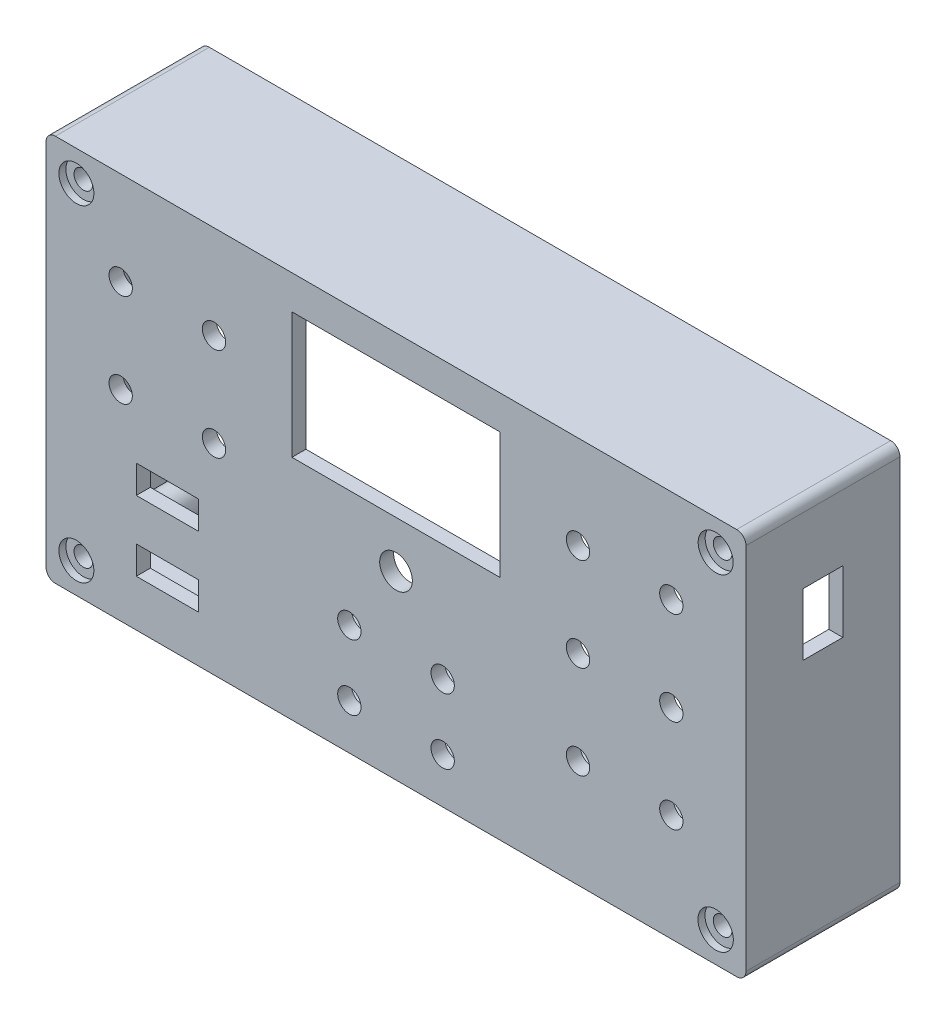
ISO-10303-21;
HEADER;
FILE_DESCRIPTION(('STEP AP214'),'2;1');
FILE_NAME('part.step','',(''),(''),'','','');
FILE_SCHEMA(('AUTOMOTIVE_DESIGN { 1 0 10303 214 1 1 1 1 }'));
ENDSEC;
DATA;
#1=APPLICATION_CONTEXT('core data for automotive mechanical design processes');
#2=APPLICATION_PROTOCOL_DEFINITION('international standard','automotive_design',2000,#1);
#3=PRODUCT_CONTEXT('',#1,'mechanical');
#4=PRODUCT('Part','Part','',(#3));
#5=PRODUCT_RELATED_PRODUCT_CATEGORY('part','',(#4));
#6=PRODUCT_DEFINITION_FORMATION('','',#4);
#7=PRODUCT_DEFINITION_CONTEXT('part definition',#1,'design');
#8=PRODUCT_DEFINITION('design','',#6,#7);
#9=PRODUCT_DEFINITION_SHAPE('','',#8);
#10=(LENGTH_UNIT() NAMED_UNIT(*) SI_UNIT(.MILLI.,.METRE.));
#11=(NAMED_UNIT(*) PLANE_ANGLE_UNIT() SI_UNIT($,.RADIAN.));
#12=(NAMED_UNIT(*) SI_UNIT($,.STERADIAN.) SOLID_ANGLE_UNIT());
#13=UNCERTAINTY_MEASURE_WITH_UNIT(LENGTH_MEASURE(1.E-05),#10,'distance_accuracy_value','');
#14=(GEOMETRIC_REPRESENTATION_CONTEXT(3) GLOBAL_UNCERTAINTY_ASSIGNED_CONTEXT((#13)) GLOBAL_UNIT_ASSIGNED_CONTEXT((#10,
#11,#12)) REPRESENTATION_CONTEXT('',''));
#15=CARTESIAN_POINT('',(0.,0.,0.));
#16=DIRECTION('',(0.,0.,1.));
#17=DIRECTION('',(1.,0.,0.));
#18=AXIS2_PLACEMENT_3D('',#15,#16,#17);
#19=CARTESIAN_POINT('',(68.5,35.,-33.));
#20=DIRECTION('',(0.,0.,1.));
#21=DIRECTION('',(1.,0.,0.));
#22=AXIS2_PLACEMENT_3D('',#19,#20,#21);
#23=CYLINDRICAL_SURFACE('',#22,2.);
#24=CARTESIAN_POINT('',(68.5,35.,-33.));
#25=DIRECTION('',(0.,0.,-1.));
#26=DIRECTION('',(-1.,0.,0.));
#27=AXIS2_PLACEMENT_3D('',#24,#25,#26);
#28=CIRCLE('',#27,2.);
#29=CARTESIAN_POINT('',(66.5,35.,-33.));
#30=VERTEX_POINT('',#29);
#31=EDGE_CURVE('E575',#30,#30,#28,.T.);
#32=ORIENTED_EDGE('',*,*,#31,.T.);
#33=EDGE_LOOP('',(#32));
#34=FACE_BOUND('',#33,.T.);
#35=CARTESIAN_POINT('',(68.5,35.,-1.5));
#36=DIRECTION('',(0.,0.,1.));
#37=DIRECTION('',(1.,0.,0.));
#38=AXIS2_PLACEMENT_3D('',#35,#36,#37);
#39=CIRCLE('',#38,2.);
#40=CARTESIAN_POINT('',(70.5,35.,-1.5));
#41=VERTEX_POINT('',#40);
#42=EDGE_CURVE('E281',#41,#41,#39,.T.);
#43=ORIENTED_EDGE('',*,*,#42,.T.);
#44=EDGE_LOOP('',(#43));
#45=FACE_BOUND('',#44,.T.);
#46=ADVANCED_FACE('F39',(#34,#45),#23,.F.);
#47=CARTESIAN_POINT('',(68.5,-35.,-33.));
#48=DIRECTION('',(0.,0.,1.));
#49=DIRECTION('',(1.,0.,0.));
#50=AXIS2_PLACEMENT_3D('',#47,#48,#49);
#51=CYLINDRICAL_SURFACE('',#50,2.);
#52=CARTESIAN_POINT('',(68.5,-35.,-33.));
#53=DIRECTION('',(0.,0.,-1.));
#54=DIRECTION('',(1.,0.,0.));
#55=AXIS2_PLACEMENT_3D('',#52,#53,#54);
#56=CIRCLE('',#55,2.);
#57=CARTESIAN_POINT('',(70.5,-35.,-33.));
#58=VERTEX_POINT('',#57);
#59=EDGE_CURVE('E560',#58,#58,#56,.T.);
#60=ORIENTED_EDGE('',*,*,#59,.T.);
#61=EDGE_LOOP('',(#60));
#62=FACE_BOUND('',#61,.T.);
#63=CARTESIAN_POINT('',(68.5,-35.,-1.5));
#64=DIRECTION('',(0.,0.,1.));
#65=DIRECTION('',(1.,0.,0.));
#66=AXIS2_PLACEMENT_3D('',#63,#64,#65);
#67=CIRCLE('',#66,2.);
#68=CARTESIAN_POINT('',(70.5,-35.,-1.5));
#69=VERTEX_POINT('',#68);
#70=EDGE_CURVE('E296',#69,#69,#67,.T.);
#71=ORIENTED_EDGE('',*,*,#70,.T.);
#72=EDGE_LOOP('',(#71));
#73=FACE_BOUND('',#72,.T.);
#74=ADVANCED_FACE('F707',(#62,#73),#51,.F.);
#75=CARTESIAN_POINT('',(-68.5,-35.,-33.));
#76=DIRECTION('',(0.,0.,1.));
#77=DIRECTION('',(1.,0.,0.));
#78=AXIS2_PLACEMENT_3D('',#75,#76,#77);
#79=CYLINDRICAL_SURFACE('',#78,2.);
#80=CARTESIAN_POINT('',(-68.5,-35.,-33.));
#81=DIRECTION('',(0.,0.,-1.));
#82=DIRECTION('',(-1.,0.,0.));
#83=AXIS2_PLACEMENT_3D('',#80,#81,#82);
#84=CIRCLE('',#83,2.);
#85=CARTESIAN_POINT('',(-70.5,-35.,-33.));
#86=VERTEX_POINT('',#85);
#87=EDGE_CURVE('E545',#86,#86,#84,.T.);
#88=ORIENTED_EDGE('',*,*,#87,.T.);
#89=EDGE_LOOP('',(#88));
#90=FACE_BOUND('',#89,.T.);
#91=CARTESIAN_POINT('',(-68.5,-35.,-1.5));
#92=DIRECTION('',(0.,0.,1.));
#93=DIRECTION('',(1.,0.,0.));
#94=AXIS2_PLACEMENT_3D('',#91,#92,#93);
#95=CIRCLE('',#94,2.);
#96=CARTESIAN_POINT('',(-66.5,-35.,-1.5));
#97=VERTEX_POINT('',#96);
#98=EDGE_CURVE('E285',#97,#97,#95,.T.);
#99=ORIENTED_EDGE('',*,*,#98,.T.);
#100=EDGE_LOOP('',(#99));
#101=FACE_BOUND('',#100,.T.);
#102=ADVANCED_FACE('F714',(#90,#101),#79,.F.);
#103=CARTESIAN_POINT('',(-68.5,35.,-33.));
#104=DIRECTION('',(0.,0.,1.));
#105=DIRECTION('',(1.,0.,0.));
#106=AXIS2_PLACEMENT_3D('',#103,#104,#105);
#107=CYLINDRICAL_SURFACE('',#106,2.);
#108=CARTESIAN_POINT('',(-68.5,35.,-33.));
#109=DIRECTION('',(0.,0.,-1.));
#110=DIRECTION('',(1.,0.,0.));
#111=AXIS2_PLACEMENT_3D('',#108,#109,#110);
#112=CIRCLE('',#111,2.);
#113=CARTESIAN_POINT('',(-66.5,35.,-33.));
#114=VERTEX_POINT('',#113);
#115=EDGE_CURVE('E524',#114,#114,#112,.T.);
#116=ORIENTED_EDGE('',*,*,#115,.T.);
#117=EDGE_LOOP('',(#116));
#118=FACE_BOUND('',#117,.T.);
#119=CARTESIAN_POINT('',(-68.5,35.,-1.5));
#120=DIRECTION('',(0.,0.,1.));
#121=DIRECTION('',(1.,0.,0.));
#122=AXIS2_PLACEMENT_3D('',#119,#120,#121);
#123=CIRCLE('',#122,2.);
#124=CARTESIAN_POINT('',(-66.5,35.,-1.5));
#125=VERTEX_POINT('',#124);
#126=EDGE_CURVE('E293',#125,#125,#123,.T.);
#127=ORIENTED_EDGE('',*,*,#126,.T.);
#128=EDGE_LOOP('',(#127));
#129=FACE_BOUND('',#128,.T.);
#130=ADVANCED_FACE('F812',(#118,#129),#107,.F.);
#131=CARTESIAN_POINT('',(53.2,-38.5,-6.85));
#132=DIRECTION('',(0.,-1.,0.));
#133=DIRECTION('',(1.,0.,0.));
#134=AXIS2_PLACEMENT_3D('',#131,#132,#133);
#135=CYLINDRICAL_SURFACE('',#134,2.);
#136=CARTESIAN_POINT('',(53.2,-38.5,-6.85));
#137=DIRECTION('',(0.,-1.,0.));
#138=DIRECTION('',(1.,0.,0.));
#139=AXIS2_PLACEMENT_3D('',#136,#137,#138);
#140=CIRCLE('',#139,2.);
#141=CARTESIAN_POINT('',(55.2,-38.5,-6.85));
#142=VERTEX_POINT('',#141);
#143=EDGE_CURVE('E329',#142,#142,#140,.T.);
#144=ORIENTED_EDGE('',*,*,#143,.F.);
#145=EDGE_LOOP('',(#144));
#146=FACE_BOUND('',#145,.T.);
#147=CARTESIAN_POINT('',(53.2,-40.,-6.85));
#148=DIRECTION('',(0.,-1.,0.));
#149=DIRECTION('',(1.,0.,0.));
#150=AXIS2_PLACEMENT_3D('',#147,#148,#149);
#151=CIRCLE('',#150,2.);
#152=CARTESIAN_POINT('',(55.2,-40.,-6.85));
#153=VERTEX_POINT('',#152);
#154=EDGE_CURVE('E321',#153,#153,#151,.T.);
#155=ORIENTED_EDGE('',*,*,#154,.T.);
#156=EDGE_LOOP('',(#155));
#157=FACE_BOUND('',#156,.T.);
#158=ADVANCED_FACE('F808',(#146,#157),#135,.F.);
#159=CARTESIAN_POINT('',(20.2,-38.5,-26.15));
#160=DIRECTION('',(0.,-1.,0.));
#161=DIRECTION('',(1.,0.,0.));
#162=AXIS2_PLACEMENT_3D('',#159,#160,#161);
#163=CYLINDRICAL_SURFACE('',#162,2.);
#164=CARTESIAN_POINT('',(20.2,-38.5,-26.15));
#165=DIRECTION('',(0.,-1.,0.));
#166=DIRECTION('',(1.,0.,0.));
#167=AXIS2_PLACEMENT_3D('',#164,#165,#166);
#168=CIRCLE('',#167,2.);
#169=CARTESIAN_POINT('',(22.2,-38.5,-26.15));
#170=VERTEX_POINT('',#169);
#171=EDGE_CURVE('E339',#170,#170,#168,.T.);
#172=ORIENTED_EDGE('',*,*,#171,.F.);
#173=EDGE_LOOP('',(#172));
#174=FACE_BOUND('',#173,.T.);
#175=CARTESIAN_POINT('',(20.2,-40.,-26.15));
#176=DIRECTION('',(0.,-1.,0.));
#177=DIRECTION('',(1.,0.,0.));
#178=AXIS2_PLACEMENT_3D('',#175,#176,#177);
#179=CIRCLE('',#178,2.);
#180=CARTESIAN_POINT('',(22.2,-40.,-26.15));
#181=VERTEX_POINT('',#180);
#182=EDGE_CURVE('E318',#181,#181,#179,.T.);
#183=ORIENTED_EDGE('',*,*,#182,.T.);
#184=EDGE_LOOP('',(#183));
#185=FACE_BOUND('',#184,.T.);
#186=ADVANCED_FACE('F730',(#174,#185),#163,.F.);
#187=CARTESIAN_POINT('',(-72.,38.5,-33.));
#188=DIRECTION('',(0.,-1.,0.));
#189=DIRECTION('',(0.,0.,-1.));
#190=AXIS2_PLACEMENT_3D('',#187,#188,#189);
#191=PLANE('',#190);
#192=DIRECTION('',(1.,0.,0.));
#193=VECTOR('',#192,1.);
#194=CARTESIAN_POINT('',(-72.,38.5,-3.));
#195=LINE('',#194,#193);
#196=CARTESIAN_POINT('',(-68.5,38.5,-3.));
#197=VERTEX_POINT('',#196);
#198=CARTESIAN_POINT('',(68.5,38.5,-3.));
#199=VERTEX_POINT('',#198);
#200=EDGE_CURVE('E594',#197,#199,#195,.T.);
#201=ORIENTED_EDGE('',*,*,#200,.F.);
#202=DIRECTION('',(0.,0.,1.));
#203=VECTOR('',#202,1.);
#204=CARTESIAN_POINT('',(-68.5,38.5,-33.));
#205=LINE('',#204,#203);
#206=CARTESIAN_POINT('',(-68.5,38.5,-33.));
#207=VERTEX_POINT('',#206);
#208=EDGE_CURVE('E537',#207,#197,#205,.T.);
#209=ORIENTED_EDGE('',*,*,#208,.F.);
#210=DIRECTION('',(1.,0.,0.));
#211=VECTOR('',#210,1.);
#212=CARTESIAN_POINT('',(-72.,38.5,-33.));
#213=LINE('',#212,#211);
#214=CARTESIAN_POINT('',(68.5,38.5,-33.));
#215=VERTEX_POINT('',#214);
#216=EDGE_CURVE('E598',#207,#215,#213,.T.);
#217=ORIENTED_EDGE('',*,*,#216,.T.);
#218=DIRECTION('',(0.,0.,1.));
#219=VECTOR('',#218,1.);
#220=CARTESIAN_POINT('',(68.5,38.5,-33.));
#221=LINE('',#220,#219);
#222=EDGE_CURVE('E587',#215,#199,#221,.T.);
#223=ORIENTED_EDGE('',*,*,#222,.T.);
#224=EDGE_LOOP('',(#201,#209,#217,#223));
#225=FACE_BOUND('',#224,.T.);
#226=ADVANCED_FACE('F726',(#225),#191,.T.);
#227=CARTESIAN_POINT('',(-72.,-38.5,-33.));
#228=DIRECTION('',(1.,0.,0.));
#229=DIRECTION('',(0.,0.,-1.));
#230=AXIS2_PLACEMENT_3D('',#227,#228,#229);
#231=PLANE('',#230);
#232=DIRECTION('',(0.,0.,1.));
#233=VECTOR('',#232,1.);
#234=CARTESIAN_POINT('',(-72.,35.,-33.));
#235=LINE('',#234,#233);
#236=CARTESIAN_POINT('',(-72.,35.,-33.));
#237=VERTEX_POINT('',#236);
#238=CARTESIAN_POINT('',(-72.,35.,-3.));
#239=VERTEX_POINT('',#238);
#240=EDGE_CURVE('E542',#237,#239,#235,.T.);
#241=ORIENTED_EDGE('',*,*,#240,.T.);
#242=DIRECTION('',(0.,1.,0.));
#243=VECTOR('',#242,1.);
#244=CARTESIAN_POINT('',(-72.,-38.5,-3.));
#245=LINE('',#244,#243);
#246=CARTESIAN_POINT('',(-72.,-35.,-3.));
#247=VERTEX_POINT('',#246);
#248=EDGE_CURVE('E604',#247,#239,#245,.T.);
#249=ORIENTED_EDGE('',*,*,#248,.F.);
#250=DIRECTION('',(0.,0.,1.));
#251=VECTOR('',#250,1.);
#252=CARTESIAN_POINT('',(-72.,-35.,-33.));
#253=LINE('',#252,#251);
#254=CARTESIAN_POINT('',(-72.,-35.,-33.));
#255=VERTEX_POINT('',#254);
#256=EDGE_CURVE('E552',#255,#247,#253,.T.);
#257=ORIENTED_EDGE('',*,*,#256,.F.);
#258=DIRECTION('',(0.,1.,0.));
#259=VECTOR('',#258,1.);
#260=CARTESIAN_POINT('',(-72.,-38.5,-33.));
#261=LINE('',#260,#259);
#262=EDGE_CURVE('E596',#255,#237,#261,.T.);
#263=ORIENTED_EDGE('',*,*,#262,.T.);
#264=EDGE_LOOP('',(#241,#249,#257,#263));
#265=FACE_BOUND('',#264,.T.);
#266=ADVANCED_FACE('F729',(#265),#231,.T.);
#267=CARTESIAN_POINT('',(-72.,-38.5,-33.));
#268=DIRECTION('',(0.,1.,0.));
#269=DIRECTION('',(0.,0.,1.));
#270=AXIS2_PLACEMENT_3D('',#267,#268,#269);
#271=PLANE('',#270);
#272=ORIENTED_EDGE('',*,*,#171,.T.);
#273=EDGE_LOOP('',(#272));
#274=FACE_BOUND('',#273,.T.);
#275=ORIENTED_EDGE('',*,*,#143,.T.);
#276=EDGE_LOOP('',(#275));
#277=FACE_BOUND('',#276,.T.);
#278=DIRECTION('',(0.,0.,1.));
#279=VECTOR('',#278,1.);
#280=CARTESIAN_POINT('',(-68.5,-38.5,-33.));
#281=LINE('',#280,#279);
#282=CARTESIAN_POINT('',(-68.5,-38.5,-33.));
#283=VERTEX_POINT('',#282);
#284=CARTESIAN_POINT('',(-68.5,-38.5,-3.));
#285=VERTEX_POINT('',#284);
#286=EDGE_CURVE('E557',#283,#285,#281,.T.);
#287=ORIENTED_EDGE('',*,*,#286,.T.);
#288=DIRECTION('',(-1.,0.,0.));
#289=VECTOR('',#288,1.);
#290=CARTESIAN_POINT('',(-72.,-38.5,-3.));
#291=LINE('',#290,#289);
#292=CARTESIAN_POINT('',(68.5,-38.5,-3.));
#293=VERTEX_POINT('',#292);
#294=EDGE_CURVE('E602',#293,#285,#291,.T.);
#295=ORIENTED_EDGE('',*,*,#294,.F.);
#296=DIRECTION('',(0.,0.,1.));
#297=VECTOR('',#296,1.);
#298=CARTESIAN_POINT('',(68.5,-38.5,-33.));
#299=LINE('',#298,#297);
#300=CARTESIAN_POINT('',(68.5,-38.5,-33.));
#301=VERTEX_POINT('',#300);
#302=EDGE_CURVE('E567',#301,#293,#299,.T.);
#303=ORIENTED_EDGE('',*,*,#302,.F.);
#304=DIRECTION('',(-1.,0.,0.));
#305=VECTOR('',#304,1.);
#306=CARTESIAN_POINT('',(-72.,-38.5,-33.));
#307=LINE('',#306,#305);
#308=EDGE_CURVE('E593',#301,#283,#307,.T.);
#309=ORIENTED_EDGE('',*,*,#308,.T.);
#310=EDGE_LOOP('',(#287,#295,#303,#309));
#311=FACE_BOUND('',#310,.T.);
#312=ADVANCED_FACE('F734',(#274,#277,#311),#271,.T.);
#313=CARTESIAN_POINT('',(72.,-38.5,-33.));
#314=DIRECTION('',(-1.,0.,0.));
#315=DIRECTION('',(0.,0.,1.));
#316=AXIS2_PLACEMENT_3D('',#313,#314,#315);
#317=PLANE('',#316);
#318=DIRECTION('',(0.,-1.,0.));
#319=VECTOR('',#318,1.);
#320=CARTESIAN_POINT('',(72.,12.1,-12.25));
#321=LINE('',#320,#319);
#322=CARTESIAN_POINT('',(72.,25.4,-12.25));
#323=VERTEX_POINT('',#322);
#324=CARTESIAN_POINT('',(72.,12.1,-12.25));
#325=VERTEX_POINT('',#324);
#326=EDGE_CURVE('E250',#323,#325,#321,.T.);
#327=ORIENTED_EDGE('',*,*,#326,.T.);
#328=DIRECTION('',(0.,0.,-1.));
#329=VECTOR('',#328,1.);
#330=CARTESIAN_POINT('',(72.,12.1,-20.75));
#331=LINE('',#330,#329);
#332=CARTESIAN_POINT('',(72.,12.1,-20.75));
#333=VERTEX_POINT('',#332);
#334=EDGE_CURVE('E259',#325,#333,#331,.T.);
#335=ORIENTED_EDGE('',*,*,#334,.T.);
#336=DIRECTION('',(0.,1.,0.));
#337=VECTOR('',#336,1.);
#338=CARTESIAN_POINT('',(72.,12.1,-20.75));
#339=LINE('',#338,#337);
#340=CARTESIAN_POINT('',(72.,25.4,-20.75));
#341=VERTEX_POINT('',#340);
#342=EDGE_CURVE('E54',#333,#341,#339,.T.);
#343=ORIENTED_EDGE('',*,*,#342,.T.);
#344=DIRECTION('',(0.,0.,1.));
#345=VECTOR('',#344,1.);
#346=CARTESIAN_POINT('',(72.,25.4,-20.75));
#347=LINE('',#346,#345);
#348=EDGE_CURVE('E256',#341,#323,#347,.T.);
#349=ORIENTED_EDGE('',*,*,#348,.T.);
#350=EDGE_LOOP('',(#327,#335,#343,#349));
#351=FACE_BOUND('',#350,.T.);
#352=DIRECTION('',(0.,0.,1.));
#353=VECTOR('',#352,1.);
#354=CARTESIAN_POINT('',(72.,-35.,-33.));
#355=LINE('',#354,#353);
#356=CARTESIAN_POINT('',(72.,-35.,-33.));
#357=VERTEX_POINT('',#356);
#358=CARTESIAN_POINT('',(72.,-35.,-3.));
#359=VERTEX_POINT('',#358);
#360=EDGE_CURVE('E572',#357,#359,#355,.T.);
#361=ORIENTED_EDGE('',*,*,#360,.T.);
#362=DIRECTION('',(0.,-1.,0.));
#363=VECTOR('',#362,1.);
#364=CARTESIAN_POINT('',(72.,-38.5,-3.));
#365=LINE('',#364,#363);
#366=CARTESIAN_POINT('',(72.,35.,-3.));
#367=VERTEX_POINT('',#366);
#368=EDGE_CURVE('E590',#367,#359,#365,.T.);
#369=ORIENTED_EDGE('',*,*,#368,.F.);
#370=DIRECTION('',(0.,0.,1.));
#371=VECTOR('',#370,1.);
#372=CARTESIAN_POINT('',(72.,35.,-33.));
#373=LINE('',#372,#371);
#374=CARTESIAN_POINT('',(72.,35.,-33.));
#375=VERTEX_POINT('',#374);
#376=EDGE_CURVE('E582',#375,#367,#373,.T.);
#377=ORIENTED_EDGE('',*,*,#376,.F.);
#378=DIRECTION('',(0.,-1.,0.));
#379=VECTOR('',#378,1.);
#380=CARTESIAN_POINT('',(72.,-38.5,-33.));
#381=LINE('',#380,#379);
#382=EDGE_CURVE('E591',#375,#357,#381,.T.);
#383=ORIENTED_EDGE('',*,*,#382,.T.);
#384=EDGE_LOOP('',(#361,#369,#377,#383));
#385=FACE_BOUND('',#384,.T.);
#386=ADVANCED_FACE('F263',(#351,#385),#317,.T.);
#387=CARTESIAN_POINT('',(-75.,-41.5,-3.));
#388=DIRECTION('',(-1.,0.,0.));
#389=DIRECTION('',(0.,0.,1.));
#390=AXIS2_PLACEMENT_3D('',#387,#388,#389);
#391=PLANE('',#390);
#392=DIRECTION('',(0.,1.,0.));
#393=VECTOR('',#392,1.);
#394=CARTESIAN_POINT('',(-75.,-41.5,-33.));
#395=LINE('',#394,#393);
#396=CARTESIAN_POINT('',(-75.,-39.5,-33.));
#397=VERTEX_POINT('',#396);
#398=CARTESIAN_POINT('',(-75.,39.5,-33.));
#399=VERTEX_POINT('',#398);
#400=EDGE_CURVE('E609',#397,#399,#395,.T.);
#401=ORIENTED_EDGE('',*,*,#400,.F.);
#402=DIRECTION('',(0.,0.,1.));
#403=VECTOR('',#402,1.);
#404=CARTESIAN_POINT('',(-75.,-39.5,-3.));
#405=LINE('',#404,#403);
#406=CARTESIAN_POINT('',(-75.,-39.5,0.));
#407=VERTEX_POINT('',#406);
#408=EDGE_CURVE('E11',#397,#407,#405,.T.);
#409=ORIENTED_EDGE('',*,*,#408,.T.);
#410=DIRECTION('',(0.,-1.,0.));
#411=VECTOR('',#410,1.);
#412=CARTESIAN_POINT('',(-75.,-41.5,0.));
#413=LINE('',#412,#411);
#414=CARTESIAN_POINT('',(-75.,39.5,0.));
#415=VERTEX_POINT('',#414);
#416=EDGE_CURVE('E618',#415,#407,#413,.T.);
#417=ORIENTED_EDGE('',*,*,#416,.F.);
#418=DIRECTION('',(0.,0.,1.));
#419=VECTOR('',#418,1.);
#420=CARTESIAN_POINT('',(-75.,39.5,-3.));
#421=LINE('',#420,#419);
#422=EDGE_CURVE('E47',#415,#399,#421,.F.);
#423=ORIENTED_EDGE('',*,*,#422,.T.);
#424=EDGE_LOOP('',(#401,#409,#417,#423));
#425=FACE_BOUND('',#424,.T.);
#426=ADVANCED_FACE('F664',(#425),#391,.T.);
#427=CARTESIAN_POINT('',(75.,41.5,-3.));
#428=DIRECTION('',(0.,1.,0.));
#429=DIRECTION('',(-1.,0.,0.));
#430=AXIS2_PLACEMENT_3D('',#427,#428,#429);
#431=PLANE('',#430);
#432=DIRECTION('',(-1.,0.,0.));
#433=VECTOR('',#432,1.);
#434=CARTESIAN_POINT('',(75.,41.5,0.));
#435=LINE('',#434,#433);
#436=CARTESIAN_POINT('',(73.,41.5,0.));
#437=VERTEX_POINT('',#436);
#438=CARTESIAN_POINT('',(-73.,41.5,0.));
#439=VERTEX_POINT('',#438);
#440=EDGE_CURVE('E627',#437,#439,#435,.T.);
#441=ORIENTED_EDGE('',*,*,#440,.F.);
#442=DIRECTION('',(0.,0.,1.));
#443=VECTOR('',#442,1.);
#444=CARTESIAN_POINT('',(73.,41.5,-3.));
#445=LINE('',#444,#443);
#446=CARTESIAN_POINT('',(73.,41.5,-33.));
#447=VERTEX_POINT('',#446);
#448=EDGE_CURVE('E659',#437,#447,#445,.F.);
#449=ORIENTED_EDGE('',*,*,#448,.T.);
#450=DIRECTION('',(1.,0.,0.));
#451=VECTOR('',#450,1.);
#452=CARTESIAN_POINT('',(-75.,41.5,-33.));
#453=LINE('',#452,#451);
#454=CARTESIAN_POINT('',(-73.,41.5,-33.));
#455=VERTEX_POINT('',#454);
#456=EDGE_CURVE('E612',#455,#447,#453,.T.);
#457=ORIENTED_EDGE('',*,*,#456,.F.);
#458=DIRECTION('',(0.,0.,1.));
#459=VECTOR('',#458,1.);
#460=CARTESIAN_POINT('',(-73.,41.5,-3.));
#461=LINE('',#460,#459);
#462=EDGE_CURVE('E656',#455,#439,#461,.T.);
#463=ORIENTED_EDGE('',*,*,#462,.T.);
#464=EDGE_LOOP('',(#441,#449,#457,#463));
#465=FACE_BOUND('',#464,.T.);
#466=ADVANCED_FACE('F676',(#465),#431,.T.);
#467=CARTESIAN_POINT('',(75.,-41.5,-3.));
#468=DIRECTION('',(1.,0.,0.));
#469=DIRECTION('',(0.,0.,-1.));
#470=AXIS2_PLACEMENT_3D('',#467,#468,#469);
#471=PLANE('',#470);
#472=DIRECTION('',(0.,-1.,0.));
#473=VECTOR('',#472,1.);
#474=CARTESIAN_POINT('',(75.,12.1,-12.25));
#475=LINE('',#474,#473);
#476=CARTESIAN_POINT('',(75.,25.4,-12.25));
#477=VERTEX_POINT('',#476);
#478=CARTESIAN_POINT('',(75.,12.1,-12.25));
#479=VERTEX_POINT('',#478);
#480=EDGE_CURVE('E62',#477,#479,#475,.T.);
#481=ORIENTED_EDGE('',*,*,#480,.F.);
#482=DIRECTION('',(0.,0.,1.));
#483=VECTOR('',#482,1.);
#484=CARTESIAN_POINT('',(75.,25.4,-20.75));
#485=LINE('',#484,#483);
#486=CARTESIAN_POINT('',(75.,25.4,-20.75));
#487=VERTEX_POINT('',#486);
#488=EDGE_CURVE('E266',#487,#477,#485,.T.);
#489=ORIENTED_EDGE('',*,*,#488,.F.);
#490=DIRECTION('',(0.,1.,0.));
#491=VECTOR('',#490,1.);
#492=CARTESIAN_POINT('',(75.,12.1,-20.75));
#493=LINE('',#492,#491);
#494=CARTESIAN_POINT('',(75.,12.1,-20.75));
#495=VERTEX_POINT('',#494);
#496=EDGE_CURVE('E269',#495,#487,#493,.T.);
#497=ORIENTED_EDGE('',*,*,#496,.F.);
#498=DIRECTION('',(0.,0.,-1.));
#499=VECTOR('',#498,1.);
#500=CARTESIAN_POINT('',(75.,12.1,-20.75));
#501=LINE('',#500,#499);
#502=EDGE_CURVE('E275',#479,#495,#501,.T.);
#503=ORIENTED_EDGE('',*,*,#502,.F.);
#504=EDGE_LOOP('',(#481,#489,#497,#503));
#505=FACE_BOUND('',#504,.T.);
#506=DIRECTION('',(0.,1.,0.));
#507=VECTOR('',#506,1.);
#508=CARTESIAN_POINT('',(75.,-41.5,0.));
#509=LINE('',#508,#507);
#510=CARTESIAN_POINT('',(75.,-39.5,0.));
#511=VERTEX_POINT('',#510);
#512=CARTESIAN_POINT('',(75.,39.5,0.));
#513=VERTEX_POINT('',#512);
#514=EDGE_CURVE('E624',#511,#513,#509,.T.);
#515=ORIENTED_EDGE('',*,*,#514,.F.);
#516=DIRECTION('',(0.,0.,1.));
#517=VECTOR('',#516,1.);
#518=CARTESIAN_POINT('',(75.,-39.5,-3.));
#519=LINE('',#518,#517);
#520=CARTESIAN_POINT('',(75.,-39.5,-33.));
#521=VERTEX_POINT('',#520);
#522=EDGE_CURVE('E646',#511,#521,#519,.F.);
#523=ORIENTED_EDGE('',*,*,#522,.T.);
#524=DIRECTION('',(0.,-1.,0.));
#525=VECTOR('',#524,1.);
#526=CARTESIAN_POINT('',(75.,41.5,-33.));
#527=LINE('',#526,#525);
#528=CARTESIAN_POINT('',(75.,39.5,-33.));
#529=VERTEX_POINT('',#528);
#530=EDGE_CURVE('E615',#529,#521,#527,.T.);
#531=ORIENTED_EDGE('',*,*,#530,.F.);
#532=DIRECTION('',(0.,0.,1.));
#533=VECTOR('',#532,1.);
#534=CARTESIAN_POINT('',(75.,39.5,-3.));
#535=LINE('',#534,#533);
#536=EDGE_CURVE('E643',#529,#513,#535,.T.);
#537=ORIENTED_EDGE('',*,*,#536,.T.);
#538=EDGE_LOOP('',(#515,#523,#531,#537));
#539=FACE_BOUND('',#538,.T.);
#540=ADVANCED_FACE('F687',(#505,#539),#471,.T.);
#541=CARTESIAN_POINT('',(75.,-41.5,-3.));
#542=DIRECTION('',(0.,-1.,0.));
#543=DIRECTION('',(1.,0.,0.));
#544=AXIS2_PLACEMENT_3D('',#541,#542,#543);
#545=PLANE('',#544);
#546=CARTESIAN_POINT('',(53.2,-41.5,-6.85));
#547=DIRECTION('',(0.,-1.,0.));
#548=DIRECTION('',(1.,0.,0.));
#549=AXIS2_PLACEMENT_3D('',#546,#547,#548);
#550=CIRCLE('',#549,3.75);
#551=CARTESIAN_POINT('',(56.95,-41.5,-6.85));
#552=VERTEX_POINT('',#551);
#553=EDGE_CURVE('E324',#552,#552,#550,.T.);
#554=ORIENTED_EDGE('',*,*,#553,.F.);
#555=EDGE_LOOP('',(#554));
#556=FACE_BOUND('',#555,.T.);
#557=CARTESIAN_POINT('',(20.2,-41.5,-26.15));
#558=DIRECTION('',(0.,-1.,0.));
#559=DIRECTION('',(1.,0.,0.));
#560=AXIS2_PLACEMENT_3D('',#557,#558,#559);
#561=CIRCLE('',#560,3.75);
#562=CARTESIAN_POINT('',(23.95,-41.5,-26.15));
#563=VERTEX_POINT('',#562);
#564=EDGE_CURVE('E334',#563,#563,#561,.T.);
#565=ORIENTED_EDGE('',*,*,#564,.F.);
#566=EDGE_LOOP('',(#565));
#567=FACE_BOUND('',#566,.T.);
#568=DIRECTION('',(-1.,0.,0.));
#569=VECTOR('',#568,1.);
#570=CARTESIAN_POINT('',(75.,-41.5,-33.));
#571=LINE('',#570,#569);
#572=CARTESIAN_POINT('',(73.,-41.5,-33.));
#573=VERTEX_POINT('',#572);
#574=CARTESIAN_POINT('',(-73.,-41.5,-33.));
#575=VERTEX_POINT('',#574);
#576=EDGE_CURVE('E600',#573,#575,#571,.T.);
#577=ORIENTED_EDGE('',*,*,#576,.F.);
#578=DIRECTION('',(0.,0.,1.));
#579=VECTOR('',#578,1.);
#580=CARTESIAN_POINT('',(73.,-41.5,-3.));
#581=LINE('',#580,#579);
#582=CARTESIAN_POINT('',(73.,-41.5,0.));
#583=VERTEX_POINT('',#582);
#584=EDGE_CURVE('E632',#573,#583,#581,.T.);
#585=ORIENTED_EDGE('',*,*,#584,.T.);
#586=DIRECTION('',(1.,0.,0.));
#587=VECTOR('',#586,1.);
#588=CARTESIAN_POINT('',(75.,-41.5,0.));
#589=LINE('',#588,#587);
#590=CARTESIAN_POINT('',(-73.,-41.5,0.));
#591=VERTEX_POINT('',#590);
#592=EDGE_CURVE('E621',#591,#583,#589,.T.);
#593=ORIENTED_EDGE('',*,*,#592,.F.);
#594=DIRECTION('',(0.,0.,1.));
#595=VECTOR('',#594,1.);
#596=CARTESIAN_POINT('',(-73.,-41.5,-3.));
#597=LINE('',#596,#595);
#598=EDGE_CURVE('E630',#591,#575,#597,.F.);
#599=ORIENTED_EDGE('',*,*,#598,.T.);
#600=EDGE_LOOP('',(#577,#585,#593,#599));
#601=FACE_BOUND('',#600,.T.);
#602=ADVANCED_FACE('F696',(#556,#567,#601),#545,.T.);
#603=CARTESIAN_POINT('',(0.,0.,0.));
#604=DIRECTION('',(0.,0.,1.));
#605=DIRECTION('',(1.,0.,0.));
#606=AXIS2_PLACEMENT_3D('',#603,#604,#605);
#607=PLANE('',#606);
#608=CARTESIAN_POINT('',(68.5,35.,0.));
#609=DIRECTION('',(0.,0.,1.));
#610=DIRECTION('',(1.,0.,0.));
#611=AXIS2_PLACEMENT_3D('',#608,#609,#610);
#612=CIRCLE('',#611,3.74999999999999);
#613=CARTESIAN_POINT('',(72.25,35.,0.));
#614=VERTEX_POINT('',#613);
#615=EDGE_CURVE('E307',#614,#614,#612,.T.);
#616=ORIENTED_EDGE('',*,*,#615,.F.);
#617=EDGE_LOOP('',(#616));
#618=FACE_BOUND('',#617,.T.);
#619=CARTESIAN_POINT('',(68.5,-35.,0.));
#620=DIRECTION('',(0.,0.,1.));
#621=DIRECTION('',(1.,0.,0.));
#622=AXIS2_PLACEMENT_3D('',#619,#620,#621);
#623=CIRCLE('',#622,3.78999999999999);
#624=CARTESIAN_POINT('',(72.29,-35.,0.));
#625=VERTEX_POINT('',#624);
#626=EDGE_CURVE('E299',#625,#625,#623,.T.);
#627=ORIENTED_EDGE('',*,*,#626,.F.);
#628=EDGE_LOOP('',(#627));
#629=FACE_BOUND('',#628,.T.);
#630=CARTESIAN_POINT('',(-68.5,-35.,0.));
#631=DIRECTION('',(0.,0.,1.));
#632=DIRECTION('',(1.,0.,0.));
#633=AXIS2_PLACEMENT_3D('',#630,#631,#632);
#634=CIRCLE('',#633,3.74999999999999);
#635=CARTESIAN_POINT('',(-64.75,-35.,0.));
#636=VERTEX_POINT('',#635);
#637=EDGE_CURVE('E288',#636,#636,#634,.T.);
#638=ORIENTED_EDGE('',*,*,#637,.F.);
#639=EDGE_LOOP('',(#638));
#640=FACE_BOUND('',#639,.T.);
#641=CARTESIAN_POINT('',(-68.5,35.,0.));
#642=DIRECTION('',(0.,0.,1.));
#643=DIRECTION('',(1.,0.,0.));
#644=AXIS2_PLACEMENT_3D('',#641,#642,#643);
#645=CIRCLE('',#644,3.75000000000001);
#646=CARTESIAN_POINT('',(-64.75,35.,0.));
#647=VERTEX_POINT('',#646);
#648=EDGE_CURVE('E314',#647,#647,#645,.T.);
#649=ORIENTED_EDGE('',*,*,#648,.F.);
#650=EDGE_LOOP('',(#649));
#651=FACE_BOUND('',#650,.T.);
#652=DIRECTION('',(0.,-1.,0.));
#653=VECTOR('',#652,1.);
#654=CARTESIAN_POINT('',(-55.6500000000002,-16.5000000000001,0.));
#655=LINE('',#654,#653);
#656=CARTESIAN_POINT('',(-55.6500000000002,-10.5000000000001,0.));
#657=VERTEX_POINT('',#656);
#658=CARTESIAN_POINT('',(-55.6500000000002,-16.5000000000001,0.));
#659=VERTEX_POINT('',#658);
#660=EDGE_CURVE('E359',#657,#659,#655,.T.);
#661=ORIENTED_EDGE('',*,*,#660,.F.);
#662=DIRECTION('',(-1.,0.,0.));
#663=VECTOR('',#662,1.);
#664=CARTESIAN_POINT('',(-42.3500000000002,-10.5000000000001,0.));
#665=LINE('',#664,#663);
#666=CARTESIAN_POINT('',(-42.3500000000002,-10.5000000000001,0.));
#667=VERTEX_POINT('',#666);
#668=EDGE_CURVE('E349',#667,#657,#665,.T.);
#669=ORIENTED_EDGE('',*,*,#668,.F.);
#670=DIRECTION('',(0.,1.,0.));
#671=VECTOR('',#670,1.);
#672=CARTESIAN_POINT('',(-42.3500000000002,-16.5000000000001,0.));
#673=LINE('',#672,#671);
#674=CARTESIAN_POINT('',(-42.3500000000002,-16.5000000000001,0.));
#675=VERTEX_POINT('',#674);
#676=EDGE_CURVE('E365',#675,#667,#673,.T.);
#677=ORIENTED_EDGE('',*,*,#676,.F.);
#678=DIRECTION('',(1.,0.,0.));
#679=VECTOR('',#678,1.);
#680=CARTESIAN_POINT('',(-42.3500000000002,-16.5000000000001,0.));
#681=LINE('',#680,#679);
#682=EDGE_CURVE('E361',#659,#675,#681,.T.);
#683=ORIENTED_EDGE('',*,*,#682,.F.);
#684=EDGE_LOOP('',(#661,#669,#677,#683));
#685=FACE_BOUND('',#684,.T.);
#686=DIRECTION('',(-1.,0.,0.));
#687=VECTOR('',#686,1.);
#688=CARTESIAN_POINT('',(-42.3500000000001,-25.5,0.));
#689=LINE('',#688,#687);
#690=CARTESIAN_POINT('',(-42.3500000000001,-25.5,0.));
#691=VERTEX_POINT('',#690);
#692=CARTESIAN_POINT('',(-55.6500000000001,-25.5000000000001,0.));
#693=VERTEX_POINT('',#692);
#694=EDGE_CURVE('E342',#691,#693,#689,.T.);
#695=ORIENTED_EDGE('',*,*,#694,.F.);
#696=DIRECTION('',(0.,1.,0.));
#697=VECTOR('',#696,1.);
#698=CARTESIAN_POINT('',(-42.3500000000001,-31.5000000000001,0.));
#699=LINE('',#698,#697);
#700=CARTESIAN_POINT('',(-42.3500000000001,-31.5000000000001,0.));
#701=VERTEX_POINT('',#700);
#702=EDGE_CURVE('E383',#701,#691,#699,.T.);
#703=ORIENTED_EDGE('',*,*,#702,.F.);
#704=DIRECTION('',(1.,0.,0.));
#705=VECTOR('',#704,1.);
#706=CARTESIAN_POINT('',(-42.3500000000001,-31.5000000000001,0.));
#707=LINE('',#706,#705);
#708=CARTESIAN_POINT('',(-55.6500000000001,-31.5000000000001,0.));
#709=VERTEX_POINT('',#708);
#710=EDGE_CURVE('E397',#709,#701,#707,.T.);
#711=ORIENTED_EDGE('',*,*,#710,.F.);
#712=DIRECTION('',(0.,-1.,0.));
#713=VECTOR('',#712,1.);
#714=CARTESIAN_POINT('',(-55.6500000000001,-31.5000000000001,0.));
#715=LINE('',#714,#713);
#716=EDGE_CURVE('E394',#693,#709,#715,.T.);
#717=ORIENTED_EDGE('',*,*,#716,.F.);
#718=EDGE_LOOP('',(#695,#703,#711,#717));
#719=FACE_BOUND('',#718,.T.);
#720=CARTESIAN_POINT('',(-59.,21.4999999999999,0.));
#721=DIRECTION('',(0.,0.,1.));
#722=DIRECTION('',(-1.,0.,0.));
#723=AXIS2_PLACEMENT_3D('',#720,#721,#722);
#724=CIRCLE('',#723,2.50000000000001);
#725=CARTESIAN_POINT('',(-61.5,21.4999999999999,0.));
#726=VERTEX_POINT('',#725);
#727=EDGE_CURVE('E412',#726,#726,#724,.T.);
#728=ORIENTED_EDGE('',*,*,#727,.F.);
#729=EDGE_LOOP('',(#728));
#730=FACE_BOUND('',#729,.T.);
#731=CARTESIAN_POINT('',(-59.0000000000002,1.49999999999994,0.));
#732=DIRECTION('',(0.,0.,1.));
#733=DIRECTION('',(-1.,0.,0.));
#734=AXIS2_PLACEMENT_3D('',#731,#732,#733);
#735=CIRCLE('',#734,2.50000000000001);
#736=CARTESIAN_POINT('',(-61.5000000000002,1.49999999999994,0.));
#737=VERTEX_POINT('',#736);
#738=EDGE_CURVE('E431',#737,#737,#735,.T.);
#739=ORIENTED_EDGE('',*,*,#738,.F.);
#740=EDGE_LOOP('',(#739));
#741=FACE_BOUND('',#740,.T.);
#742=CARTESIAN_POINT('',(-39.0000000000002,1.49999999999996,0.));
#743=DIRECTION('',(0.,0.,1.));
#744=DIRECTION('',(-1.,0.,0.));
#745=AXIS2_PLACEMENT_3D('',#742,#743,#744);
#746=CIRCLE('',#745,2.50000000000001);
#747=CARTESIAN_POINT('',(-41.5000000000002,1.49999999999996,0.));
#748=VERTEX_POINT('',#747);
#749=EDGE_CURVE('E425',#748,#748,#746,.T.);
#750=ORIENTED_EDGE('',*,*,#749,.F.);
#751=EDGE_LOOP('',(#750));
#752=FACE_BOUND('',#751,.T.);
#753=CARTESIAN_POINT('',(39.0000000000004,-18.5,0.));
#754=DIRECTION('',(0.,0.,1.));
#755=DIRECTION('',(1.,0.,0.));
#756=AXIS2_PLACEMENT_3D('',#753,#754,#755);
#757=CIRCLE('',#756,2.5);
#758=CARTESIAN_POINT('',(41.5000000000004,-18.5,0.));
#759=VERTEX_POINT('',#758);
#760=EDGE_CURVE('E419',#759,#759,#757,.T.);
#761=ORIENTED_EDGE('',*,*,#760,.F.);
#762=EDGE_LOOP('',(#761));
#763=FACE_BOUND('',#762,.T.);
#764=CARTESIAN_POINT('',(59.,21.5,0.));
#765=DIRECTION('',(0.,0.,1.));
#766=DIRECTION('',(1.,0.,0.));
#767=AXIS2_PLACEMENT_3D('',#764,#765,#766);
#768=CIRCLE('',#767,2.50000000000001);
#769=CARTESIAN_POINT('',(61.5,21.5,0.));
#770=VERTEX_POINT('',#769);
#771=EDGE_CURVE('E455',#770,#770,#768,.T.);
#772=ORIENTED_EDGE('',*,*,#771,.F.);
#773=EDGE_LOOP('',(#772));
#774=FACE_BOUND('',#773,.T.);
#775=CARTESIAN_POINT('',(59.0000000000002,1.5,0.));
#776=DIRECTION('',(0.,0.,1.));
#777=DIRECTION('',(1.,0.,0.));
#778=AXIS2_PLACEMENT_3D('',#775,#776,#777);
#779=CIRCLE('',#778,2.50000000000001);
#780=CARTESIAN_POINT('',(61.5000000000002,1.5,0.));
#781=VERTEX_POINT('',#780);
#782=EDGE_CURVE('E442',#781,#781,#779,.T.);
#783=ORIENTED_EDGE('',*,*,#782,.F.);
#784=EDGE_LOOP('',(#783));
#785=FACE_BOUND('',#784,.T.);
#786=CARTESIAN_POINT('',(59.0000000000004,-18.5,0.));
#787=DIRECTION('',(0.,0.,1.));
#788=DIRECTION('',(1.,0.,0.));
#789=AXIS2_PLACEMENT_3D('',#786,#787,#788);
#790=CIRCLE('',#789,2.50000000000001);
#791=CARTESIAN_POINT('',(61.5000000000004,-18.5,0.));
#792=VERTEX_POINT('',#791);
#793=EDGE_CURVE('E443',#792,#792,#790,.T.);
#794=ORIENTED_EDGE('',*,*,#793,.F.);
#795=EDGE_LOOP('',(#794));
#796=FACE_BOUND('',#795,.T.);
#797=CARTESIAN_POINT('',(39.0000000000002,1.5,0.));
#798=DIRECTION('',(0.,0.,1.));
#799=DIRECTION('',(1.,0.,0.));
#800=AXIS2_PLACEMENT_3D('',#797,#798,#799);
#801=CIRCLE('',#800,2.5);
#802=CARTESIAN_POINT('',(41.5000000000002,1.5,0.));
#803=VERTEX_POINT('',#802);
#804=EDGE_CURVE('E418',#803,#803,#801,.T.);
#805=ORIENTED_EDGE('',*,*,#804,.F.);
#806=EDGE_LOOP('',(#805));
#807=FACE_BOUND('',#806,.T.);
#808=CARTESIAN_POINT('',(-39.,21.5,0.));
#809=DIRECTION('',(0.,0.,1.));
#810=DIRECTION('',(-1.,0.,0.));
#811=AXIS2_PLACEMENT_3D('',#808,#809,#810);
#812=CIRCLE('',#811,2.50000000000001);
#813=CARTESIAN_POINT('',(-41.5,21.5,0.));
#814=VERTEX_POINT('',#813);
#815=EDGE_CURVE('E372',#814,#814,#812,.T.);
#816=ORIENTED_EDGE('',*,*,#815,.F.);
#817=EDGE_LOOP('',(#816));
#818=FACE_BOUND('',#817,.T.);
#819=CARTESIAN_POINT('',(39.,21.5,0.));
#820=DIRECTION('',(0.,0.,1.));
#821=DIRECTION('',(1.,0.,0.));
#822=AXIS2_PLACEMENT_3D('',#819,#820,#821);
#823=CIRCLE('',#822,2.5);
#824=CARTESIAN_POINT('',(41.5,21.5,0.));
#825=VERTEX_POINT('',#824);
#826=EDGE_CURVE('E454',#825,#825,#823,.T.);
#827=ORIENTED_EDGE('',*,*,#826,.F.);
#828=EDGE_LOOP('',(#827));
#829=FACE_BOUND('',#828,.T.);
#830=CARTESIAN_POINT('',(-10.,-31.75,0.));
#831=DIRECTION('',(0.,0.,1.));
#832=DIRECTION('',(1.,0.,0.));
#833=AXIS2_PLACEMENT_3D('',#830,#831,#832);
#834=CIRCLE('',#833,2.5);
#835=CARTESIAN_POINT('',(-7.49999999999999,-31.75,0.));
#836=VERTEX_POINT('',#835);
#837=EDGE_CURVE('E473',#836,#836,#834,.T.);
#838=ORIENTED_EDGE('',*,*,#837,.F.);
#839=EDGE_LOOP('',(#838));
#840=FACE_BOUND('',#839,.T.);
#841=CARTESIAN_POINT('',(10.,-31.75,0.));
#842=DIRECTION('',(0.,0.,1.));
#843=DIRECTION('',(-1.,0.,0.));
#844=AXIS2_PLACEMENT_3D('',#841,#842,#843);
#845=CIRCLE('',#844,2.5);
#846=CARTESIAN_POINT('',(7.49999999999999,-31.75,0.));
#847=VERTEX_POINT('',#846);
#848=EDGE_CURVE('E466',#847,#847,#845,.T.);
#849=ORIENTED_EDGE('',*,*,#848,.F.);
#850=EDGE_LOOP('',(#849));
#851=FACE_BOUND('',#850,.T.);
#852=CARTESIAN_POINT('',(-10.,-17.75,0.));
#853=DIRECTION('',(0.,0.,1.));
#854=DIRECTION('',(1.,0.,0.));
#855=AXIS2_PLACEMENT_3D('',#852,#853,#854);
#856=CIRCLE('',#855,2.5);
#857=CARTESIAN_POINT('',(-7.5,-17.75,0.));
#858=VERTEX_POINT('',#857);
#859=EDGE_CURVE('E485',#858,#858,#856,.T.);
#860=ORIENTED_EDGE('',*,*,#859,.F.);
#861=EDGE_LOOP('',(#860));
#862=FACE_BOUND('',#861,.T.);
#863=CARTESIAN_POINT('',(10.,-17.75,0.));
#864=DIRECTION('',(0.,0.,1.));
#865=DIRECTION('',(-1.,0.,0.));
#866=AXIS2_PLACEMENT_3D('',#863,#864,#865);
#867=CIRCLE('',#866,2.5);
#868=CARTESIAN_POINT('',(7.5,-17.75,0.));
#869=VERTEX_POINT('',#868);
#870=EDGE_CURVE('E472',#869,#869,#867,.T.);
#871=ORIENTED_EDGE('',*,*,#870,.F.);
#872=EDGE_LOOP('',(#871));
#873=FACE_BOUND('',#872,.T.);
#874=CARTESIAN_POINT('',(0.,-2.74999999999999,0.));
#875=DIRECTION('',(0.,0.,1.));
#876=DIRECTION('',(1.,0.,0.));
#877=AXIS2_PLACEMENT_3D('',#874,#875,#876);
#878=CIRCLE('',#877,3.5);
#879=CARTESIAN_POINT('',(3.5,-2.74999999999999,0.));
#880=VERTEX_POINT('',#879);
#881=EDGE_CURVE('E484',#880,#880,#878,.T.);
#882=ORIENTED_EDGE('',*,*,#881,.F.);
#883=EDGE_LOOP('',(#882));
#884=FACE_BOUND('',#883,.T.);
#885=DIRECTION('',(0.,-1.,0.));
#886=VECTOR('',#885,1.);
#887=CARTESIAN_POINT('',(-22.3,7.25000000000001,0.));
#888=LINE('',#887,#886);
#889=CARTESIAN_POINT('',(-22.3,34.25,0.));
#890=VERTEX_POINT('',#889);
#891=CARTESIAN_POINT('',(-22.3,7.25000000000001,0.));
#892=VERTEX_POINT('',#891);
#893=EDGE_CURVE('E496',#890,#892,#888,.T.);
#894=ORIENTED_EDGE('',*,*,#893,.F.);
#895=DIRECTION('',(-1.,0.,0.));
#896=VECTOR('',#895,1.);
#897=CARTESIAN_POINT('',(22.3,34.25,0.));
#898=LINE('',#897,#896);
#899=CARTESIAN_POINT('',(22.3,34.25,0.));
#900=VERTEX_POINT('',#899);
#901=EDGE_CURVE('E503',#900,#890,#898,.T.);
#902=ORIENTED_EDGE('',*,*,#901,.F.);
#903=DIRECTION('',(0.,1.,0.));
#904=VECTOR('',#903,1.);
#905=CARTESIAN_POINT('',(22.3,7.25000000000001,0.));
#906=LINE('',#905,#904);
#907=CARTESIAN_POINT('',(22.3,7.25000000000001,0.));
#908=VERTEX_POINT('',#907);
#909=EDGE_CURVE('E517',#908,#900,#906,.T.);
#910=ORIENTED_EDGE('',*,*,#909,.F.);
#911=DIRECTION('',(1.,0.,0.));
#912=VECTOR('',#911,1.);
#913=CARTESIAN_POINT('',(22.3,7.25000000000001,0.));
#914=LINE('',#913,#912);
#915=EDGE_CURVE('E514',#892,#908,#914,.T.);
#916=ORIENTED_EDGE('',*,*,#915,.F.);
#917=EDGE_LOOP('',(#894,#902,#910,#916));
#918=FACE_BOUND('',#917,.T.);
#919=ORIENTED_EDGE('',*,*,#592,.T.);
#920=CARTESIAN_POINT('',(73.,-39.5,0.));
#921=DIRECTION('',(0.,0.,1.));
#922=DIRECTION('',(1.,0.,0.));
#923=AXIS2_PLACEMENT_3D('',#920,#921,#922);
#924=CIRCLE('',#923,2.);
#925=EDGE_CURVE('E641',#583,#511,#924,.T.);
#926=ORIENTED_EDGE('',*,*,#925,.T.);
#927=ORIENTED_EDGE('',*,*,#514,.T.);
#928=CARTESIAN_POINT('',(73.,39.5,0.));
#929=DIRECTION('',(0.,0.,1.));
#930=DIRECTION('',(1.,0.,0.));
#931=AXIS2_PLACEMENT_3D('',#928,#929,#930);
#932=CIRCLE('',#931,2.);
#933=EDGE_CURVE('E639',#513,#437,#932,.T.);
#934=ORIENTED_EDGE('',*,*,#933,.T.);
#935=ORIENTED_EDGE('',*,*,#440,.T.);
#936=CARTESIAN_POINT('',(-73.,39.5,0.));
#937=DIRECTION('',(0.,0.,1.));
#938=DIRECTION('',(1.,0.,0.));
#939=AXIS2_PLACEMENT_3D('',#936,#937,#938);
#940=CIRCLE('',#939,2.);
#941=EDGE_CURVE('E635',#439,#415,#940,.T.);
#942=ORIENTED_EDGE('',*,*,#941,.T.);
#943=ORIENTED_EDGE('',*,*,#416,.T.);
#944=CARTESIAN_POINT('',(-73.,-39.5,0.));
#945=DIRECTION('',(0.,0.,1.));
#946=DIRECTION('',(1.,0.,0.));
#947=AXIS2_PLACEMENT_3D('',#944,#945,#946);
#948=CIRCLE('',#947,2.);
#949=EDGE_CURVE('E637',#407,#591,#948,.T.);
#950=ORIENTED_EDGE('',*,*,#949,.T.);
#951=EDGE_LOOP('',(#919,#926,#927,#934,#935,#942,#943,#950));
#952=FACE_BOUND('',#951,.T.);
#953=ADVANCED_FACE('F679',(#618,#629,#640,#651,#685,#719,#730,#741,#752,#763,#774,#785,#796,
#807,#818,#829,#840,#851,#862,#873,#884,#918,#952),#607,.T.);
#954=CARTESIAN_POINT('',(0.,0.,-33.));
#955=DIRECTION('',(0.,0.,-1.));
#956=DIRECTION('',(-1.,0.,0.));
#957=AXIS2_PLACEMENT_3D('',#954,#955,#956);
#958=PLANE('',#957);
#959=ORIENTED_EDGE('',*,*,#382,.F.);
#960=CARTESIAN_POINT('',(68.5,35.,-33.));
#961=DIRECTION('',(0.,0.,-1.));
#962=DIRECTION('',(-1.,0.,0.));
#963=AXIS2_PLACEMENT_3D('',#960,#961,#962);
#964=CIRCLE('',#963,3.50000000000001);
#965=EDGE_CURVE('E579',#375,#215,#964,.T.);
#966=ORIENTED_EDGE('',*,*,#965,.T.);
#967=ORIENTED_EDGE('',*,*,#216,.F.);
#968=CARTESIAN_POINT('',(-68.5,35.,-33.));
#969=DIRECTION('',(0.,0.,-1.));
#970=DIRECTION('',(1.,0.,0.));
#971=AXIS2_PLACEMENT_3D('',#968,#969,#970);
#972=CIRCLE('',#971,3.50000000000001);
#973=EDGE_CURVE('E534',#207,#237,#972,.T.);
#974=ORIENTED_EDGE('',*,*,#973,.T.);
#975=ORIENTED_EDGE('',*,*,#262,.F.);
#976=CARTESIAN_POINT('',(-68.5,-35.,-33.));
#977=DIRECTION('',(0.,0.,-1.));
#978=DIRECTION('',(-1.,0.,0.));
#979=AXIS2_PLACEMENT_3D('',#976,#977,#978);
#980=CIRCLE('',#979,3.50000000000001);
#981=EDGE_CURVE('E549',#255,#283,#980,.T.);
#982=ORIENTED_EDGE('',*,*,#981,.T.);
#983=ORIENTED_EDGE('',*,*,#308,.F.);
#984=CARTESIAN_POINT('',(68.5,-35.,-33.));
#985=DIRECTION('',(0.,0.,-1.));
#986=DIRECTION('',(1.,0.,0.));
#987=AXIS2_PLACEMENT_3D('',#984,#985,#986);
#988=CIRCLE('',#987,3.50000000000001);
#989=EDGE_CURVE('E564',#301,#357,#988,.T.);
#990=ORIENTED_EDGE('',*,*,#989,.T.);
#991=EDGE_LOOP('',(#959,#966,#967,#974,#975,#982,#983,#990));
#992=FACE_BOUND('',#991,.T.);
#993=ORIENTED_EDGE('',*,*,#530,.T.);
#994=CARTESIAN_POINT('',(73.,-39.5,-33.));
#995=DIRECTION('',(0.,0.,-1.));
#996=DIRECTION('',(-1.,0.,0.));
#997=AXIS2_PLACEMENT_3D('',#994,#995,#996);
#998=CIRCLE('',#997,2.);
#999=EDGE_CURVE('E654',#521,#573,#998,.T.);
#1000=ORIENTED_EDGE('',*,*,#999,.T.);
#1001=ORIENTED_EDGE('',*,*,#576,.T.);
#1002=CARTESIAN_POINT('',(-73.,-39.5,-33.));
#1003=DIRECTION('',(0.,0.,-1.));
#1004=DIRECTION('',(-1.,0.,0.));
#1005=AXIS2_PLACEMENT_3D('',#1002,#1003,#1004);
#1006=CIRCLE('',#1005,2.);
#1007=EDGE_CURVE('E650',#575,#397,#1006,.T.);
#1008=ORIENTED_EDGE('',*,*,#1007,.T.);
#1009=ORIENTED_EDGE('',*,*,#400,.T.);
#1010=CARTESIAN_POINT('',(-73.,39.5,-33.));
#1011=DIRECTION('',(0.,0.,-1.));
#1012=DIRECTION('',(-1.,0.,0.));
#1013=AXIS2_PLACEMENT_3D('',#1010,#1011,#1012);
#1014=CIRCLE('',#1013,2.);
#1015=EDGE_CURVE('E648',#399,#455,#1014,.T.);
#1016=ORIENTED_EDGE('',*,*,#1015,.T.);
#1017=ORIENTED_EDGE('',*,*,#456,.T.);
#1018=CARTESIAN_POINT('',(73.,39.5,-33.));
#1019=DIRECTION('',(0.,0.,-1.));
#1020=DIRECTION('',(-1.,0.,0.));
#1021=AXIS2_PLACEMENT_3D('',#1018,#1019,#1020);
#1022=CIRCLE('',#1021,2.);
#1023=EDGE_CURVE('E652',#447,#529,#1022,.T.);
#1024=ORIENTED_EDGE('',*,*,#1023,.T.);
#1025=EDGE_LOOP('',(#993,#1000,#1001,#1008,#1009,#1016,#1017,#1024));
#1026=FACE_BOUND('',#1025,.T.);
#1027=ORIENTED_EDGE('',*,*,#31,.F.);
#1028=EDGE_LOOP('',(#1027));
#1029=FACE_BOUND('',#1028,.T.);
#1030=ORIENTED_EDGE('',*,*,#59,.F.);
#1031=EDGE_LOOP('',(#1030));
#1032=FACE_BOUND('',#1031,.T.);
#1033=ORIENTED_EDGE('',*,*,#87,.F.);
#1034=EDGE_LOOP('',(#1033));
#1035=FACE_BOUND('',#1034,.T.);
#1036=ORIENTED_EDGE('',*,*,#115,.F.);
#1037=EDGE_LOOP('',(#1036));
#1038=FACE_BOUND('',#1037,.T.);
#1039=ADVANCED_FACE('F669',(#992,#1026,#1029,#1032,#1035,#1038),#958,.T.);
#1040=CARTESIAN_POINT('',(0.,0.,-3.));
#1041=DIRECTION('',(0.,0.,1.));
#1042=DIRECTION('',(1.,0.,0.));
#1043=AXIS2_PLACEMENT_3D('',#1040,#1041,#1042);
#1044=PLANE('',#1043);
#1045=DIRECTION('',(-1.,0.,0.));
#1046=VECTOR('',#1045,1.);
#1047=CARTESIAN_POINT('',(-42.3500000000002,-10.5000000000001,-3.));
#1048=LINE('',#1047,#1046);
#1049=CARTESIAN_POINT('',(-42.3500000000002,-10.5000000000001,-3.));
#1050=VERTEX_POINT('',#1049);
#1051=CARTESIAN_POINT('',(-55.6500000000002,-10.5000000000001,-3.));
#1052=VERTEX_POINT('',#1051);
#1053=EDGE_CURVE('E355',#1050,#1052,#1048,.T.);
#1054=ORIENTED_EDGE('',*,*,#1053,.T.);
#1055=DIRECTION('',(0.,-1.,0.));
#1056=VECTOR('',#1055,1.);
#1057=CARTESIAN_POINT('',(-55.6500000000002,-16.5000000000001,-3.));
#1058=LINE('',#1057,#1056);
#1059=CARTESIAN_POINT('',(-55.6500000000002,-16.5000000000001,-3.));
#1060=VERTEX_POINT('',#1059);
#1061=EDGE_CURVE('E345',#1052,#1060,#1058,.T.);
#1062=ORIENTED_EDGE('',*,*,#1061,.T.);
#1063=DIRECTION('',(1.,0.,0.));
#1064=VECTOR('',#1063,1.);
#1065=CARTESIAN_POINT('',(-42.3500000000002,-16.5000000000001,-3.));
#1066=LINE('',#1065,#1064);
#1067=CARTESIAN_POINT('',(-42.3500000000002,-16.5000000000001,-3.));
#1068=VERTEX_POINT('',#1067);
#1069=EDGE_CURVE('E348',#1060,#1068,#1066,.T.);
#1070=ORIENTED_EDGE('',*,*,#1069,.T.);
#1071=DIRECTION('',(0.,1.,0.));
#1072=VECTOR('',#1071,1.);
#1073=CARTESIAN_POINT('',(-42.3500000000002,-16.5000000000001,-3.));
#1074=LINE('',#1073,#1072);
#1075=EDGE_CURVE('E352',#1068,#1050,#1074,.T.);
#1076=ORIENTED_EDGE('',*,*,#1075,.T.);
#1077=EDGE_LOOP('',(#1054,#1062,#1070,#1076));
#1078=FACE_BOUND('',#1077,.T.);
#1079=DIRECTION('',(0.,1.,0.));
#1080=VECTOR('',#1079,1.);
#1081=CARTESIAN_POINT('',(-42.3500000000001,-31.5000000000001,-3.));
#1082=LINE('',#1081,#1080);
#1083=CARTESIAN_POINT('',(-42.3500000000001,-31.5000000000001,-3.));
#1084=VERTEX_POINT('',#1083);
#1085=CARTESIAN_POINT('',(-42.3500000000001,-25.5,-3.));
#1086=VERTEX_POINT('',#1085);
#1087=EDGE_CURVE('E389',#1084,#1086,#1082,.T.);
#1088=ORIENTED_EDGE('',*,*,#1087,.T.);
#1089=DIRECTION('',(-1.,0.,0.));
#1090=VECTOR('',#1089,1.);
#1091=CARTESIAN_POINT('',(-42.3500000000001,-25.5,-3.));
#1092=LINE('',#1091,#1090);
#1093=CARTESIAN_POINT('',(-55.6500000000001,-25.5000000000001,-3.));
#1094=VERTEX_POINT('',#1093);
#1095=EDGE_CURVE('E379',#1086,#1094,#1092,.T.);
#1096=ORIENTED_EDGE('',*,*,#1095,.T.);
#1097=DIRECTION('',(0.,-1.,0.));
#1098=VECTOR('',#1097,1.);
#1099=CARTESIAN_POINT('',(-55.6500000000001,-31.5000000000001,-3.));
#1100=LINE('',#1099,#1098);
#1101=CARTESIAN_POINT('',(-55.6500000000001,-31.5000000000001,-3.));
#1102=VERTEX_POINT('',#1101);
#1103=EDGE_CURVE('E382',#1094,#1102,#1100,.T.);
#1104=ORIENTED_EDGE('',*,*,#1103,.T.);
#1105=DIRECTION('',(1.,0.,0.));
#1106=VECTOR('',#1105,1.);
#1107=CARTESIAN_POINT('',(-42.3500000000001,-31.5000000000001,-3.));
#1108=LINE('',#1107,#1106);
#1109=EDGE_CURVE('E386',#1102,#1084,#1108,.T.);
#1110=ORIENTED_EDGE('',*,*,#1109,.T.);
#1111=EDGE_LOOP('',(#1088,#1096,#1104,#1110));
#1112=FACE_BOUND('',#1111,.T.);
#1113=CARTESIAN_POINT('',(-59.,21.4999999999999,-3.));
#1114=DIRECTION('',(0.,0.,1.));
#1115=DIRECTION('',(-1.,0.,0.));
#1116=AXIS2_PLACEMENT_3D('',#1113,#1114,#1115);
#1117=CIRCLE('',#1116,2.50000000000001);
#1118=CARTESIAN_POINT('',(-61.5,21.4999999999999,-3.));
#1119=VERTEX_POINT('',#1118);
#1120=EDGE_CURVE('E434',#1119,#1119,#1117,.T.);
#1121=ORIENTED_EDGE('',*,*,#1120,.T.);
#1122=EDGE_LOOP('',(#1121));
#1123=FACE_BOUND('',#1122,.T.);
#1124=CARTESIAN_POINT('',(-59.0000000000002,1.49999999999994,-3.));
#1125=DIRECTION('',(0.,0.,1.));
#1126=DIRECTION('',(-1.,0.,0.));
#1127=AXIS2_PLACEMENT_3D('',#1124,#1125,#1126);
#1128=CIRCLE('',#1127,2.50000000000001);
#1129=CARTESIAN_POINT('',(-61.5000000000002,1.49999999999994,-3.));
#1130=VERTEX_POINT('',#1129);
#1131=EDGE_CURVE('E428',#1130,#1130,#1128,.T.);
#1132=ORIENTED_EDGE('',*,*,#1131,.T.);
#1133=EDGE_LOOP('',(#1132));
#1134=FACE_BOUND('',#1133,.T.);
#1135=CARTESIAN_POINT('',(-39.0000000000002,1.49999999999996,-3.));
#1136=DIRECTION('',(0.,0.,1.));
#1137=DIRECTION('',(-1.,0.,0.));
#1138=AXIS2_PLACEMENT_3D('',#1135,#1136,#1137);
#1139=CIRCLE('',#1138,2.50000000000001);
#1140=CARTESIAN_POINT('',(-41.5000000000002,1.49999999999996,-3.));
#1141=VERTEX_POINT('',#1140);
#1142=EDGE_CURVE('E422',#1141,#1141,#1139,.T.);
#1143=ORIENTED_EDGE('',*,*,#1142,.T.);
#1144=EDGE_LOOP('',(#1143));
#1145=FACE_BOUND('',#1144,.T.);
#1146=CARTESIAN_POINT('',(39.0000000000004,-18.5,-3.));
#1147=DIRECTION('',(0.,0.,1.));
#1148=DIRECTION('',(1.,0.,0.));
#1149=AXIS2_PLACEMENT_3D('',#1146,#1147,#1148);
#1150=CIRCLE('',#1149,2.5);
#1151=CARTESIAN_POINT('',(41.5000000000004,-18.5,-3.));
#1152=VERTEX_POINT('',#1151);
#1153=EDGE_CURVE('E415',#1152,#1152,#1150,.T.);
#1154=ORIENTED_EDGE('',*,*,#1153,.T.);
#1155=EDGE_LOOP('',(#1154));
#1156=FACE_BOUND('',#1155,.T.);
#1157=CARTESIAN_POINT('',(59.,21.5,-3.));
#1158=DIRECTION('',(0.,0.,1.));
#1159=DIRECTION('',(1.,0.,0.));
#1160=AXIS2_PLACEMENT_3D('',#1157,#1158,#1159);
#1161=CIRCLE('',#1160,2.50000000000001);
#1162=CARTESIAN_POINT('',(61.5,21.5,-3.));
#1163=VERTEX_POINT('',#1162);
#1164=EDGE_CURVE('E451',#1163,#1163,#1161,.T.);
#1165=ORIENTED_EDGE('',*,*,#1164,.T.);
#1166=EDGE_LOOP('',(#1165));
#1167=FACE_BOUND('',#1166,.T.);
#1168=CARTESIAN_POINT('',(59.0000000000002,1.5,-3.));
#1169=DIRECTION('',(0.,0.,1.));
#1170=DIRECTION('',(1.,0.,0.));
#1171=AXIS2_PLACEMENT_3D('',#1168,#1169,#1170);
#1172=CIRCLE('',#1171,2.50000000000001);
#1173=CARTESIAN_POINT('',(61.5000000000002,1.5,-3.));
#1174=VERTEX_POINT('',#1173);
#1175=EDGE_CURVE('E458',#1174,#1174,#1172,.T.);
#1176=ORIENTED_EDGE('',*,*,#1175,.T.);
#1177=EDGE_LOOP('',(#1176));
#1178=FACE_BOUND('',#1177,.T.);
#1179=CARTESIAN_POINT('',(59.0000000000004,-18.5,-3.));
#1180=DIRECTION('',(0.,0.,1.));
#1181=DIRECTION('',(1.,0.,0.));
#1182=AXIS2_PLACEMENT_3D('',#1179,#1180,#1181);
#1183=CIRCLE('',#1182,2.50000000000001);
#1184=CARTESIAN_POINT('',(61.5000000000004,-18.5,-3.));
#1185=VERTEX_POINT('',#1184);
#1186=EDGE_CURVE('E439',#1185,#1185,#1183,.T.);
#1187=ORIENTED_EDGE('',*,*,#1186,.T.);
#1188=EDGE_LOOP('',(#1187));
#1189=FACE_BOUND('',#1188,.T.);
#1190=CARTESIAN_POINT('',(39.0000000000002,1.5,-3.));
#1191=DIRECTION('',(0.,0.,1.));
#1192=DIRECTION('',(1.,0.,0.));
#1193=AXIS2_PLACEMENT_3D('',#1190,#1191,#1192);
#1194=CIRCLE('',#1193,2.5);
#1195=CARTESIAN_POINT('',(41.5000000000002,1.5,-3.));
#1196=VERTEX_POINT('',#1195);
#1197=EDGE_CURVE('E446',#1196,#1196,#1194,.T.);
#1198=ORIENTED_EDGE('',*,*,#1197,.T.);
#1199=EDGE_LOOP('',(#1198));
#1200=FACE_BOUND('',#1199,.T.);
#1201=CARTESIAN_POINT('',(-39.,21.5,-3.));
#1202=DIRECTION('',(0.,0.,1.));
#1203=DIRECTION('',(-1.,0.,0.));
#1204=AXIS2_PLACEMENT_3D('',#1201,#1202,#1203);
#1205=CIRCLE('',#1204,2.50000000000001);
#1206=CARTESIAN_POINT('',(-41.5,21.5,-3.));
#1207=VERTEX_POINT('',#1206);
#1208=EDGE_CURVE('E409',#1207,#1207,#1205,.T.);
#1209=ORIENTED_EDGE('',*,*,#1208,.T.);
#1210=EDGE_LOOP('',(#1209));
#1211=FACE_BOUND('',#1210,.T.);
#1212=CARTESIAN_POINT('',(39.,21.5,-3.));
#1213=DIRECTION('',(0.,0.,1.));
#1214=DIRECTION('',(1.,0.,0.));
#1215=AXIS2_PLACEMENT_3D('',#1212,#1213,#1214);
#1216=CIRCLE('',#1215,2.5);
#1217=CARTESIAN_POINT('',(41.5,21.5,-3.));
#1218=VERTEX_POINT('',#1217);
#1219=EDGE_CURVE('E463',#1218,#1218,#1216,.T.);
#1220=ORIENTED_EDGE('',*,*,#1219,.T.);
#1221=EDGE_LOOP('',(#1220));
#1222=FACE_BOUND('',#1221,.T.);
#1223=CARTESIAN_POINT('',(-10.,-31.75,-3.));
#1224=DIRECTION('',(0.,0.,1.));
#1225=DIRECTION('',(1.,0.,0.));
#1226=AXIS2_PLACEMENT_3D('',#1223,#1224,#1225);
#1227=CIRCLE('',#1226,2.5);
#1228=CARTESIAN_POINT('',(-7.49999999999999,-31.75,-3.));
#1229=VERTEX_POINT('',#1228);
#1230=EDGE_CURVE('E469',#1229,#1229,#1227,.T.);
#1231=ORIENTED_EDGE('',*,*,#1230,.T.);
#1232=EDGE_LOOP('',(#1231));
#1233=FACE_BOUND('',#1232,.T.);
#1234=CARTESIAN_POINT('',(10.,-31.75,-3.));
#1235=DIRECTION('',(0.,0.,1.));
#1236=DIRECTION('',(-1.,0.,0.));
#1237=AXIS2_PLACEMENT_3D('',#1234,#1235,#1236);
#1238=CIRCLE('',#1237,2.5);
#1239=CARTESIAN_POINT('',(7.49999999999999,-31.75,-3.));
#1240=VERTEX_POINT('',#1239);
#1241=EDGE_CURVE('E476',#1240,#1240,#1238,.T.);
#1242=ORIENTED_EDGE('',*,*,#1241,.T.);
#1243=EDGE_LOOP('',(#1242));
#1244=FACE_BOUND('',#1243,.T.);
#1245=CARTESIAN_POINT('',(-10.,-17.75,-3.));
#1246=DIRECTION('',(0.,0.,1.));
#1247=DIRECTION('',(1.,0.,0.));
#1248=AXIS2_PLACEMENT_3D('',#1245,#1246,#1247);
#1249=CIRCLE('',#1248,2.5);
#1250=CARTESIAN_POINT('',(-7.5,-17.75,-3.));
#1251=VERTEX_POINT('',#1250);
#1252=EDGE_CURVE('E481',#1251,#1251,#1249,.T.);
#1253=ORIENTED_EDGE('',*,*,#1252,.T.);
#1254=EDGE_LOOP('',(#1253));
#1255=FACE_BOUND('',#1254,.T.);
#1256=CARTESIAN_POINT('',(10.,-17.75,-3.));
#1257=DIRECTION('',(0.,0.,1.));
#1258=DIRECTION('',(-1.,0.,0.));
#1259=AXIS2_PLACEMENT_3D('',#1256,#1257,#1258);
#1260=CIRCLE('',#1259,2.5);
#1261=CARTESIAN_POINT('',(7.5,-17.75,-3.));
#1262=VERTEX_POINT('',#1261);
#1263=EDGE_CURVE('E488',#1262,#1262,#1260,.T.);
#1264=ORIENTED_EDGE('',*,*,#1263,.T.);
#1265=EDGE_LOOP('',(#1264));
#1266=FACE_BOUND('',#1265,.T.);
#1267=CARTESIAN_POINT('',(0.,-2.74999999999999,-3.));
#1268=DIRECTION('',(0.,0.,1.));
#1269=DIRECTION('',(1.,0.,0.));
#1270=AXIS2_PLACEMENT_3D('',#1267,#1268,#1269);
#1271=CIRCLE('',#1270,3.5);
#1272=CARTESIAN_POINT('',(3.5,-2.74999999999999,-3.));
#1273=VERTEX_POINT('',#1272);
#1274=EDGE_CURVE('E493',#1273,#1273,#1271,.T.);
#1275=ORIENTED_EDGE('',*,*,#1274,.T.);
#1276=EDGE_LOOP('',(#1275));
#1277=FACE_BOUND('',#1276,.T.);
#1278=DIRECTION('',(-1.,0.,0.));
#1279=VECTOR('',#1278,1.);
#1280=CARTESIAN_POINT('',(22.3,34.25,-3.));
#1281=LINE('',#1280,#1279);
#1282=CARTESIAN_POINT('',(22.3,34.25,-3.));
#1283=VERTEX_POINT('',#1282);
#1284=CARTESIAN_POINT('',(-22.3,34.25,-3.));
#1285=VERTEX_POINT('',#1284);
#1286=EDGE_CURVE('E509',#1283,#1285,#1281,.T.);
#1287=ORIENTED_EDGE('',*,*,#1286,.T.);
#1288=DIRECTION('',(0.,-1.,0.));
#1289=VECTOR('',#1288,1.);
#1290=CARTESIAN_POINT('',(-22.3,7.25000000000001,-3.));
#1291=LINE('',#1290,#1289);
#1292=CARTESIAN_POINT('',(-22.3,7.25000000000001,-3.));
#1293=VERTEX_POINT('',#1292);
#1294=EDGE_CURVE('E499',#1285,#1293,#1291,.T.);
#1295=ORIENTED_EDGE('',*,*,#1294,.T.);
#1296=DIRECTION('',(1.,0.,0.));
#1297=VECTOR('',#1296,1.);
#1298=CARTESIAN_POINT('',(22.3,7.25000000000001,-3.));
#1299=LINE('',#1298,#1297);
#1300=CARTESIAN_POINT('',(22.3,7.25000000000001,-3.));
#1301=VERTEX_POINT('',#1300);
#1302=EDGE_CURVE('E502',#1293,#1301,#1299,.T.);
#1303=ORIENTED_EDGE('',*,*,#1302,.T.);
#1304=DIRECTION('',(0.,1.,0.));
#1305=VECTOR('',#1304,1.);
#1306=CARTESIAN_POINT('',(22.3,7.25000000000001,-3.));
#1307=LINE('',#1306,#1305);
#1308=EDGE_CURVE('E506',#1301,#1283,#1307,.T.);
#1309=ORIENTED_EDGE('',*,*,#1308,.T.);
#1310=EDGE_LOOP('',(#1287,#1295,#1303,#1309));
#1311=FACE_BOUND('',#1310,.T.);
#1312=CARTESIAN_POINT('',(-68.5,35.,-3.));
#1313=DIRECTION('',(0.,0.,-1.));
#1314=DIRECTION('',(1.,0.,0.));
#1315=AXIS2_PLACEMENT_3D('',#1312,#1313,#1314);
#1316=CIRCLE('',#1315,3.50000000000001);
#1317=EDGE_CURVE('E533',#197,#239,#1316,.T.);
#1318=ORIENTED_EDGE('',*,*,#1317,.F.);
#1319=ORIENTED_EDGE('',*,*,#200,.T.);
#1320=CARTESIAN_POINT('',(68.5,35.,-3.));
#1321=DIRECTION('',(0.,0.,-1.));
#1322=DIRECTION('',(-1.,0.,0.));
#1323=AXIS2_PLACEMENT_3D('',#1320,#1321,#1322);
#1324=CIRCLE('',#1323,3.50000000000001);
#1325=EDGE_CURVE('E578',#367,#199,#1324,.T.);
#1326=ORIENTED_EDGE('',*,*,#1325,.F.);
#1327=ORIENTED_EDGE('',*,*,#368,.T.);
#1328=CARTESIAN_POINT('',(68.5,-35.,-3.));
#1329=DIRECTION('',(0.,0.,-1.));
#1330=DIRECTION('',(1.,0.,0.));
#1331=AXIS2_PLACEMENT_3D('',#1328,#1329,#1330);
#1332=CIRCLE('',#1331,3.50000000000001);
#1333=EDGE_CURVE('E563',#293,#359,#1332,.T.);
#1334=ORIENTED_EDGE('',*,*,#1333,.F.);
#1335=ORIENTED_EDGE('',*,*,#294,.T.);
#1336=CARTESIAN_POINT('',(-68.5,-35.,-3.));
#1337=DIRECTION('',(0.,0.,-1.));
#1338=DIRECTION('',(-1.,0.,0.));
#1339=AXIS2_PLACEMENT_3D('',#1336,#1337,#1338);
#1340=CIRCLE('',#1339,3.50000000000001);
#1341=EDGE_CURVE('E548',#247,#285,#1340,.T.);
#1342=ORIENTED_EDGE('',*,*,#1341,.F.);
#1343=ORIENTED_EDGE('',*,*,#248,.T.);
#1344=EDGE_LOOP('',(#1318,#1319,#1326,#1327,#1334,#1335,#1342,#1343));
#1345=FACE_BOUND('',#1344,.T.);
#1346=ADVANCED_FACE('F724',(#1078,#1112,#1123,#1134,#1145,#1156,#1167,#1178,#1189,#1200,#1211,
#1222,#1233,#1244,#1255,#1266,#1277,#1311,#1345),#1044,.F.);
#1347=CARTESIAN_POINT('',(68.5,35.,-33.));
#1348=DIRECTION('',(0.,0.,1.));
#1349=DIRECTION('',(1.,0.,0.));
#1350=AXIS2_PLACEMENT_3D('',#1347,#1348,#1349);
#1351=CYLINDRICAL_SURFACE('',#1350,3.50000000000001);
#1352=ORIENTED_EDGE('',*,*,#1325,.T.);
#1353=ORIENTED_EDGE('',*,*,#222,.F.);
#1354=ORIENTED_EDGE('',*,*,#965,.F.);
#1355=ORIENTED_EDGE('',*,*,#376,.T.);
#1356=EDGE_LOOP('',(#1352,#1353,#1354,#1355));
#1357=FACE_BOUND('',#1356,.T.);
#1358=ADVANCED_FACE('F721',(#1357),#1351,.T.);
#1359=CARTESIAN_POINT('',(68.5,-35.,-33.));
#1360=DIRECTION('',(0.,0.,1.));
#1361=DIRECTION('',(1.,0.,0.));
#1362=AXIS2_PLACEMENT_3D('',#1359,#1360,#1361);
#1363=CYLINDRICAL_SURFACE('',#1362,3.50000000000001);
#1364=ORIENTED_EDGE('',*,*,#1333,.T.);
#1365=ORIENTED_EDGE('',*,*,#360,.F.);
#1366=ORIENTED_EDGE('',*,*,#989,.F.);
#1367=ORIENTED_EDGE('',*,*,#302,.T.);
#1368=EDGE_LOOP('',(#1364,#1365,#1366,#1367));
#1369=FACE_BOUND('',#1368,.T.);
#1370=ADVANCED_FACE('F720',(#1369),#1363,.T.);
#1371=CARTESIAN_POINT('',(-68.5,-35.,-33.));
#1372=DIRECTION('',(0.,0.,1.));
#1373=DIRECTION('',(1.,0.,0.));
#1374=AXIS2_PLACEMENT_3D('',#1371,#1372,#1373);
#1375=CYLINDRICAL_SURFACE('',#1374,3.50000000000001);
#1376=ORIENTED_EDGE('',*,*,#1341,.T.);
#1377=ORIENTED_EDGE('',*,*,#286,.F.);
#1378=ORIENTED_EDGE('',*,*,#981,.F.);
#1379=ORIENTED_EDGE('',*,*,#256,.T.);
#1380=EDGE_LOOP('',(#1376,#1377,#1378,#1379));
#1381=FACE_BOUND('',#1380,.T.);
#1382=ADVANCED_FACE('F927',(#1381),#1375,.T.);
#1383=CARTESIAN_POINT('',(-68.5,35.,-33.));
#1384=DIRECTION('',(0.,0.,1.));
#1385=DIRECTION('',(1.,0.,0.));
#1386=AXIS2_PLACEMENT_3D('',#1383,#1384,#1385);
#1387=CYLINDRICAL_SURFACE('',#1386,3.50000000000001);
#1388=ORIENTED_EDGE('',*,*,#1317,.T.);
#1389=ORIENTED_EDGE('',*,*,#240,.F.);
#1390=ORIENTED_EDGE('',*,*,#973,.F.);
#1391=ORIENTED_EDGE('',*,*,#208,.T.);
#1392=EDGE_LOOP('',(#1388,#1389,#1390,#1391));
#1393=FACE_BOUND('',#1392,.T.);
#1394=ADVANCED_FACE('F920',(#1393),#1387,.T.);
#1395=CARTESIAN_POINT('',(-22.3,7.25000000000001,-3.));
#1396=DIRECTION('',(-1.,0.,0.));
#1397=DIRECTION('',(0.,0.,1.));
#1398=AXIS2_PLACEMENT_3D('',#1395,#1396,#1397);
#1399=PLANE('',#1398);
#1400=ORIENTED_EDGE('',*,*,#893,.T.);
#1401=DIRECTION('',(0.,0.,1.));
#1402=VECTOR('',#1401,1.);
#1403=CARTESIAN_POINT('',(-22.3,7.25000000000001,-3.));
#1404=LINE('',#1403,#1402);
#1405=EDGE_CURVE('E512',#1293,#892,#1404,.T.);
#1406=ORIENTED_EDGE('',*,*,#1405,.F.);
#1407=ORIENTED_EDGE('',*,*,#1294,.F.);
#1408=DIRECTION('',(0.,0.,1.));
#1409=VECTOR('',#1408,1.);
#1410=CARTESIAN_POINT('',(-22.3,34.25,-3.));
#1411=LINE('',#1410,#1409);
#1412=EDGE_CURVE('E522',#1285,#890,#1411,.T.);
#1413=ORIENTED_EDGE('',*,*,#1412,.T.);
#1414=EDGE_LOOP('',(#1400,#1406,#1407,#1413));
#1415=FACE_BOUND('',#1414,.T.);
#1416=ADVANCED_FACE('F910',(#1415),#1399,.F.);
#1417=CARTESIAN_POINT('',(22.3,34.25,-3.));
#1418=DIRECTION('',(0.,1.,0.));
#1419=DIRECTION('',(-1.,0.,0.));
#1420=AXIS2_PLACEMENT_3D('',#1417,#1418,#1419);
#1421=PLANE('',#1420);
#1422=ORIENTED_EDGE('',*,*,#901,.T.);
#1423=ORIENTED_EDGE('',*,*,#1412,.F.);
#1424=ORIENTED_EDGE('',*,*,#1286,.F.);
#1425=DIRECTION('',(0.,0.,1.));
#1426=VECTOR('',#1425,1.);
#1427=CARTESIAN_POINT('',(22.3,34.25,-3.));
#1428=LINE('',#1427,#1426);
#1429=EDGE_CURVE('E525',#1283,#900,#1428,.T.);
#1430=ORIENTED_EDGE('',*,*,#1429,.T.);
#1431=EDGE_LOOP('',(#1422,#1423,#1424,#1430));
#1432=FACE_BOUND('',#1431,.T.);
#1433=ADVANCED_FACE('F906',(#1432),#1421,.F.);
#1434=CARTESIAN_POINT('',(22.3,7.25000000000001,-3.));
#1435=DIRECTION('',(1.,0.,0.));
#1436=DIRECTION('',(0.,0.,-1.));
#1437=AXIS2_PLACEMENT_3D('',#1434,#1435,#1436);
#1438=PLANE('',#1437);
#1439=ORIENTED_EDGE('',*,*,#909,.T.);
#1440=ORIENTED_EDGE('',*,*,#1429,.F.);
#1441=ORIENTED_EDGE('',*,*,#1308,.F.);
#1442=DIRECTION('',(0.,0.,1.));
#1443=VECTOR('',#1442,1.);
#1444=CARTESIAN_POINT('',(22.3,7.25000000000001,-3.));
#1445=LINE('',#1444,#1443);
#1446=EDGE_CURVE('E527',#1301,#908,#1445,.T.);
#1447=ORIENTED_EDGE('',*,*,#1446,.T.);
#1448=EDGE_LOOP('',(#1439,#1440,#1441,#1447));
#1449=FACE_BOUND('',#1448,.T.);
#1450=ADVANCED_FACE('F909',(#1449),#1438,.F.);
#1451=CARTESIAN_POINT('',(22.3,7.25000000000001,-3.));
#1452=DIRECTION('',(0.,-1.,0.));
#1453=DIRECTION('',(1.,0.,0.));
#1454=AXIS2_PLACEMENT_3D('',#1451,#1452,#1453);
#1455=PLANE('',#1454);
#1456=ORIENTED_EDGE('',*,*,#915,.T.);
#1457=ORIENTED_EDGE('',*,*,#1446,.F.);
#1458=ORIENTED_EDGE('',*,*,#1302,.F.);
#1459=ORIENTED_EDGE('',*,*,#1405,.T.);
#1460=EDGE_LOOP('',(#1456,#1457,#1458,#1459));
#1461=FACE_BOUND('',#1460,.T.);
#1462=ADVANCED_FACE('F904',(#1461),#1455,.F.);
#1463=CARTESIAN_POINT('',(0.,-2.74999999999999,-3.));
#1464=DIRECTION('',(0.,0.,1.));
#1465=DIRECTION('',(1.,0.,0.));
#1466=AXIS2_PLACEMENT_3D('',#1463,#1464,#1465);
#1467=CYLINDRICAL_SURFACE('',#1466,3.5);
#1468=ORIENTED_EDGE('',*,*,#1274,.F.);
#1469=EDGE_LOOP('',(#1468));
#1470=FACE_BOUND('',#1469,.T.);
#1471=ORIENTED_EDGE('',*,*,#881,.T.);
#1472=EDGE_LOOP('',(#1471));
#1473=FACE_BOUND('',#1472,.T.);
#1474=ADVANCED_FACE('F900',(#1470,#1473),#1467,.F.);
#1475=CARTESIAN_POINT('',(10.,-17.75,-3.));
#1476=DIRECTION('',(0.,0.,1.));
#1477=DIRECTION('',(1.,0.,0.));
#1478=AXIS2_PLACEMENT_3D('',#1475,#1476,#1477);
#1479=CYLINDRICAL_SURFACE('',#1478,2.5);
#1480=ORIENTED_EDGE('',*,*,#1263,.F.);
#1481=EDGE_LOOP('',(#1480));
#1482=FACE_BOUND('',#1481,.T.);
#1483=ORIENTED_EDGE('',*,*,#870,.T.);
#1484=EDGE_LOOP('',(#1483));
#1485=FACE_BOUND('',#1484,.T.);
#1486=ADVANCED_FACE('F896',(#1482,#1485),#1479,.F.);
#1487=CARTESIAN_POINT('',(-10.,-17.75,-3.));
#1488=DIRECTION('',(0.,0.,1.));
#1489=DIRECTION('',(1.,0.,0.));
#1490=AXIS2_PLACEMENT_3D('',#1487,#1488,#1489);
#1491=CYLINDRICAL_SURFACE('',#1490,2.5);
#1492=ORIENTED_EDGE('',*,*,#1252,.F.);
#1493=EDGE_LOOP('',(#1492));
#1494=FACE_BOUND('',#1493,.T.);
#1495=ORIENTED_EDGE('',*,*,#859,.T.);
#1496=EDGE_LOOP('',(#1495));
#1497=FACE_BOUND('',#1496,.T.);
#1498=ADVANCED_FACE('F892',(#1494,#1497),#1491,.F.);
#1499=CARTESIAN_POINT('',(10.,-31.75,-3.));
#1500=DIRECTION('',(0.,0.,1.));
#1501=DIRECTION('',(1.,0.,0.));
#1502=AXIS2_PLACEMENT_3D('',#1499,#1500,#1501);
#1503=CYLINDRICAL_SURFACE('',#1502,2.5);
#1504=ORIENTED_EDGE('',*,*,#1241,.F.);
#1505=EDGE_LOOP('',(#1504));
#1506=FACE_BOUND('',#1505,.T.);
#1507=ORIENTED_EDGE('',*,*,#848,.T.);
#1508=EDGE_LOOP('',(#1507));
#1509=FACE_BOUND('',#1508,.T.);
#1510=ADVANCED_FACE('F888',(#1506,#1509),#1503,.F.);
#1511=CARTESIAN_POINT('',(-10.,-31.75,-3.));
#1512=DIRECTION('',(0.,0.,1.));
#1513=DIRECTION('',(1.,0.,0.));
#1514=AXIS2_PLACEMENT_3D('',#1511,#1512,#1513);
#1515=CYLINDRICAL_SURFACE('',#1514,2.5);
#1516=ORIENTED_EDGE('',*,*,#1230,.F.);
#1517=EDGE_LOOP('',(#1516));
#1518=FACE_BOUND('',#1517,.T.);
#1519=ORIENTED_EDGE('',*,*,#837,.T.);
#1520=EDGE_LOOP('',(#1519));
#1521=FACE_BOUND('',#1520,.T.);
#1522=ADVANCED_FACE('F884',(#1518,#1521),#1515,.F.);
#1523=CARTESIAN_POINT('',(39.,21.5,-3.));
#1524=DIRECTION('',(0.,0.,1.));
#1525=DIRECTION('',(1.,0.,0.));
#1526=AXIS2_PLACEMENT_3D('',#1523,#1524,#1525);
#1527=CYLINDRICAL_SURFACE('',#1526,2.5);
#1528=ORIENTED_EDGE('',*,*,#1219,.F.);
#1529=EDGE_LOOP('',(#1528));
#1530=FACE_BOUND('',#1529,.T.);
#1531=ORIENTED_EDGE('',*,*,#826,.T.);
#1532=EDGE_LOOP('',(#1531));
#1533=FACE_BOUND('',#1532,.T.);
#1534=ADVANCED_FACE('F850',(#1530,#1533),#1527,.F.);
#1535=CARTESIAN_POINT('',(-39.,21.5,-3.));
#1536=DIRECTION('',(0.,0.,1.));
#1537=DIRECTION('',(1.,0.,0.));
#1538=AXIS2_PLACEMENT_3D('',#1535,#1536,#1537);
#1539=CYLINDRICAL_SURFACE('',#1538,2.50000000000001);
#1540=ORIENTED_EDGE('',*,*,#1208,.F.);
#1541=EDGE_LOOP('',(#1540));
#1542=FACE_BOUND('',#1541,.T.);
#1543=ORIENTED_EDGE('',*,*,#815,.T.);
#1544=EDGE_LOOP('',(#1543));
#1545=FACE_BOUND('',#1544,.T.);
#1546=ADVANCED_FACE('F846',(#1542,#1545),#1539,.F.);
#1547=CARTESIAN_POINT('',(39.0000000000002,1.5,-3.));
#1548=DIRECTION('',(0.,0.,1.));
#1549=DIRECTION('',(1.,0.,0.));
#1550=AXIS2_PLACEMENT_3D('',#1547,#1548,#1549);
#1551=CYLINDRICAL_SURFACE('',#1550,2.5);
#1552=ORIENTED_EDGE('',*,*,#1197,.F.);
#1553=EDGE_LOOP('',(#1552));
#1554=FACE_BOUND('',#1553,.T.);
#1555=ORIENTED_EDGE('',*,*,#804,.T.);
#1556=EDGE_LOOP('',(#1555));
#1557=FACE_BOUND('',#1556,.T.);
#1558=ADVANCED_FACE('F849',(#1554,#1557),#1551,.F.);
#1559=CARTESIAN_POINT('',(59.0000000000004,-18.5,-3.));
#1560=DIRECTION('',(0.,0.,1.));
#1561=DIRECTION('',(1.,0.,0.));
#1562=AXIS2_PLACEMENT_3D('',#1559,#1560,#1561);
#1563=CYLINDRICAL_SURFACE('',#1562,2.50000000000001);
#1564=ORIENTED_EDGE('',*,*,#1186,.F.);
#1565=EDGE_LOOP('',(#1564));
#1566=FACE_BOUND('',#1565,.T.);
#1567=ORIENTED_EDGE('',*,*,#793,.T.);
#1568=EDGE_LOOP('',(#1567));
#1569=FACE_BOUND('',#1568,.T.);
#1570=ADVANCED_FACE('F868',(#1566,#1569),#1563,.F.);
#1571=CARTESIAN_POINT('',(59.0000000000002,1.5,-3.));
#1572=DIRECTION('',(0.,0.,1.));
#1573=DIRECTION('',(1.,0.,0.));
#1574=AXIS2_PLACEMENT_3D('',#1571,#1572,#1573);
#1575=CYLINDRICAL_SURFACE('',#1574,2.50000000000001);
#1576=ORIENTED_EDGE('',*,*,#1175,.F.);
#1577=EDGE_LOOP('',(#1576));
#1578=FACE_BOUND('',#1577,.T.);
#1579=ORIENTED_EDGE('',*,*,#782,.T.);
#1580=EDGE_LOOP('',(#1579));
#1581=FACE_BOUND('',#1580,.T.);
#1582=ADVANCED_FACE('F871',(#1578,#1581),#1575,.F.);
#1583=CARTESIAN_POINT('',(59.,21.5,-3.));
#1584=DIRECTION('',(0.,0.,1.));
#1585=DIRECTION('',(1.,0.,0.));
#1586=AXIS2_PLACEMENT_3D('',#1583,#1584,#1585);
#1587=CYLINDRICAL_SURFACE('',#1586,2.50000000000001);
#1588=ORIENTED_EDGE('',*,*,#1164,.F.);
#1589=EDGE_LOOP('',(#1588));
#1590=FACE_BOUND('',#1589,.T.);
#1591=ORIENTED_EDGE('',*,*,#771,.T.);
#1592=EDGE_LOOP('',(#1591));
#1593=FACE_BOUND('',#1592,.T.);
#1594=ADVANCED_FACE('F856',(#1590,#1593),#1587,.F.);
#1595=CARTESIAN_POINT('',(39.0000000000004,-18.5,-3.));
#1596=DIRECTION('',(0.,0.,1.));
#1597=DIRECTION('',(1.,0.,0.));
#1598=AXIS2_PLACEMENT_3D('',#1595,#1596,#1597);
#1599=CYLINDRICAL_SURFACE('',#1598,2.5);
#1600=ORIENTED_EDGE('',*,*,#1153,.F.);
#1601=EDGE_LOOP('',(#1600));
#1602=FACE_BOUND('',#1601,.T.);
#1603=ORIENTED_EDGE('',*,*,#760,.T.);
#1604=EDGE_LOOP('',(#1603));
#1605=FACE_BOUND('',#1604,.T.);
#1606=ADVANCED_FACE('F852',(#1602,#1605),#1599,.F.);
#1607=CARTESIAN_POINT('',(-39.0000000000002,1.49999999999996,-3.));
#1608=DIRECTION('',(0.,0.,1.));
#1609=DIRECTION('',(1.,0.,0.));
#1610=AXIS2_PLACEMENT_3D('',#1607,#1608,#1609);
#1611=CYLINDRICAL_SURFACE('',#1610,2.50000000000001);
#1612=ORIENTED_EDGE('',*,*,#1142,.F.);
#1613=EDGE_LOOP('',(#1612));
#1614=FACE_BOUND('',#1613,.T.);
#1615=ORIENTED_EDGE('',*,*,#749,.T.);
#1616=EDGE_LOOP('',(#1615));
#1617=FACE_BOUND('',#1616,.T.);
#1618=ADVANCED_FACE('F855',(#1614,#1617),#1611,.F.);
#1619=CARTESIAN_POINT('',(-59.0000000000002,1.49999999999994,-3.));
#1620=DIRECTION('',(0.,0.,1.));
#1621=DIRECTION('',(1.,0.,0.));
#1622=AXIS2_PLACEMENT_3D('',#1619,#1620,#1621);
#1623=CYLINDRICAL_SURFACE('',#1622,2.50000000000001);
#1624=ORIENTED_EDGE('',*,*,#1131,.F.);
#1625=EDGE_LOOP('',(#1624));
#1626=FACE_BOUND('',#1625,.T.);
#1627=ORIENTED_EDGE('',*,*,#738,.T.);
#1628=EDGE_LOOP('',(#1627));
#1629=FACE_BOUND('',#1628,.T.);
#1630=ADVANCED_FACE('F860',(#1626,#1629),#1623,.F.);
#1631=CARTESIAN_POINT('',(-59.,21.4999999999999,-3.));
#1632=DIRECTION('',(0.,0.,1.));
#1633=DIRECTION('',(1.,0.,0.));
#1634=AXIS2_PLACEMENT_3D('',#1631,#1632,#1633);
#1635=CYLINDRICAL_SURFACE('',#1634,2.50000000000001);
#1636=ORIENTED_EDGE('',*,*,#1120,.F.);
#1637=EDGE_LOOP('',(#1636));
#1638=FACE_BOUND('',#1637,.T.);
#1639=ORIENTED_EDGE('',*,*,#727,.T.);
#1640=EDGE_LOOP('',(#1639));
#1641=FACE_BOUND('',#1640,.T.);
#1642=ADVANCED_FACE('F844',(#1638,#1641),#1635,.F.);
#1643=CARTESIAN_POINT('',(-42.3500000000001,-25.5,-3.));
#1644=DIRECTION('',(0.,1.,0.));
#1645=DIRECTION('',(-1.,0.,0.));
#1646=AXIS2_PLACEMENT_3D('',#1643,#1644,#1645);
#1647=PLANE('',#1646);
#1648=ORIENTED_EDGE('',*,*,#694,.T.);
#1649=DIRECTION('',(0.,0.,1.));
#1650=VECTOR('',#1649,1.);
#1651=CARTESIAN_POINT('',(-55.6500000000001,-25.5000000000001,-3.));
#1652=LINE('',#1651,#1650);
#1653=EDGE_CURVE('E392',#1094,#693,#1652,.T.);
#1654=ORIENTED_EDGE('',*,*,#1653,.F.);
#1655=ORIENTED_EDGE('',*,*,#1095,.F.);
#1656=DIRECTION('',(0.,0.,1.));
#1657=VECTOR('',#1656,1.);
#1658=CARTESIAN_POINT('',(-42.3500000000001,-25.5,-3.));
#1659=LINE('',#1658,#1657);
#1660=EDGE_CURVE('E362',#1086,#691,#1659,.T.);
#1661=ORIENTED_EDGE('',*,*,#1660,.T.);
#1662=EDGE_LOOP('',(#1648,#1654,#1655,#1661));
#1663=FACE_BOUND('',#1662,.T.);
#1664=ADVANCED_FACE('F834',(#1663),#1647,.F.);
#1665=CARTESIAN_POINT('',(-42.3500000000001,-31.5000000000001,-3.));
#1666=DIRECTION('',(1.,0.,0.));
#1667=DIRECTION('',(0.,0.,-1.));
#1668=AXIS2_PLACEMENT_3D('',#1665,#1666,#1667);
#1669=PLANE('',#1668);
#1670=ORIENTED_EDGE('',*,*,#702,.T.);
#1671=ORIENTED_EDGE('',*,*,#1660,.F.);
#1672=ORIENTED_EDGE('',*,*,#1087,.F.);
#1673=DIRECTION('',(0.,0.,1.));
#1674=VECTOR('',#1673,1.);
#1675=CARTESIAN_POINT('',(-42.3500000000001,-31.5000000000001,-3.));
#1676=LINE('',#1675,#1674);
#1677=EDGE_CURVE('E403',#1084,#701,#1676,.T.);
#1678=ORIENTED_EDGE('',*,*,#1677,.T.);
#1679=EDGE_LOOP('',(#1670,#1671,#1672,#1678));
#1680=FACE_BOUND('',#1679,.T.);
#1681=ADVANCED_FACE('F830',(#1680),#1669,.F.);
#1682=CARTESIAN_POINT('',(-42.3500000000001,-31.5000000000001,-3.));
#1683=DIRECTION('',(0.,-1.,0.));
#1684=DIRECTION('',(0.,0.,-1.));
#1685=AXIS2_PLACEMENT_3D('',#1682,#1683,#1684);
#1686=PLANE('',#1685);
#1687=ORIENTED_EDGE('',*,*,#710,.T.);
#1688=ORIENTED_EDGE('',*,*,#1677,.F.);
#1689=ORIENTED_EDGE('',*,*,#1109,.F.);
#1690=DIRECTION('',(0.,0.,1.));
#1691=VECTOR('',#1690,1.);
#1692=CARTESIAN_POINT('',(-55.6500000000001,-31.5000000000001,-3.));
#1693=LINE('',#1692,#1691);
#1694=EDGE_CURVE('E405',#1102,#709,#1693,.T.);
#1695=ORIENTED_EDGE('',*,*,#1694,.T.);
#1696=EDGE_LOOP('',(#1687,#1688,#1689,#1695));
#1697=FACE_BOUND('',#1696,.T.);
#1698=ADVANCED_FACE('F833',(#1697),#1686,.F.);
#1699=CARTESIAN_POINT('',(-55.6500000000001,-31.5000000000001,-3.));
#1700=DIRECTION('',(-1.,0.,0.));
#1701=DIRECTION('',(0.,0.,1.));
#1702=AXIS2_PLACEMENT_3D('',#1699,#1700,#1701);
#1703=PLANE('',#1702);
#1704=ORIENTED_EDGE('',*,*,#716,.T.);
#1705=ORIENTED_EDGE('',*,*,#1694,.F.);
#1706=ORIENTED_EDGE('',*,*,#1103,.F.);
#1707=ORIENTED_EDGE('',*,*,#1653,.T.);
#1708=EDGE_LOOP('',(#1704,#1705,#1706,#1707));
#1709=FACE_BOUND('',#1708,.T.);
#1710=ADVANCED_FACE('F828',(#1709),#1703,.F.);
#1711=CARTESIAN_POINT('',(-55.6500000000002,-16.5000000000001,-3.));
#1712=DIRECTION('',(-1.,0.,0.));
#1713=DIRECTION('',(0.,0.,1.));
#1714=AXIS2_PLACEMENT_3D('',#1711,#1712,#1713);
#1715=PLANE('',#1714);
#1716=ORIENTED_EDGE('',*,*,#660,.T.);
#1717=DIRECTION('',(0.,0.,1.));
#1718=VECTOR('',#1717,1.);
#1719=CARTESIAN_POINT('',(-55.6500000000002,-16.5000000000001,-3.));
#1720=LINE('',#1719,#1718);
#1721=EDGE_CURVE('E358',#1060,#659,#1720,.T.);
#1722=ORIENTED_EDGE('',*,*,#1721,.F.);
#1723=ORIENTED_EDGE('',*,*,#1061,.F.);
#1724=DIRECTION('',(0.,0.,1.));
#1725=VECTOR('',#1724,1.);
#1726=CARTESIAN_POINT('',(-55.6500000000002,-10.5000000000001,-3.));
#1727=LINE('',#1726,#1725);
#1728=EDGE_CURVE('E370',#1052,#657,#1727,.T.);
#1729=ORIENTED_EDGE('',*,*,#1728,.T.);
#1730=EDGE_LOOP('',(#1716,#1722,#1723,#1729));
#1731=FACE_BOUND('',#1730,.T.);
#1732=ADVANCED_FACE('F818',(#1731),#1715,.F.);
#1733=CARTESIAN_POINT('',(-42.3500000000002,-10.5000000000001,-3.));
#1734=DIRECTION('',(0.,1.,0.));
#1735=DIRECTION('',(-1.,0.,0.));
#1736=AXIS2_PLACEMENT_3D('',#1733,#1734,#1735);
#1737=PLANE('',#1736);
#1738=ORIENTED_EDGE('',*,*,#668,.T.);
#1739=ORIENTED_EDGE('',*,*,#1728,.F.);
#1740=ORIENTED_EDGE('',*,*,#1053,.F.);
#1741=DIRECTION('',(0.,0.,1.));
#1742=VECTOR('',#1741,1.);
#1743=CARTESIAN_POINT('',(-42.3500000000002,-10.5000000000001,-3.));
#1744=LINE('',#1743,#1742);
#1745=EDGE_CURVE('E373',#1050,#667,#1744,.T.);
#1746=ORIENTED_EDGE('',*,*,#1745,.T.);
#1747=EDGE_LOOP('',(#1738,#1739,#1740,#1746));
#1748=FACE_BOUND('',#1747,.T.);
#1749=ADVANCED_FACE('F814',(#1748),#1737,.F.);
#1750=CARTESIAN_POINT('',(-42.3500000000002,-16.5000000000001,-3.));
#1751=DIRECTION('',(1.,0.,0.));
#1752=DIRECTION('',(0.,0.,-1.));
#1753=AXIS2_PLACEMENT_3D('',#1750,#1751,#1752);
#1754=PLANE('',#1753);
#1755=ORIENTED_EDGE('',*,*,#676,.T.);
#1756=ORIENTED_EDGE('',*,*,#1745,.F.);
#1757=ORIENTED_EDGE('',*,*,#1075,.F.);
#1758=DIRECTION('',(0.,0.,1.));
#1759=VECTOR('',#1758,1.);
#1760=CARTESIAN_POINT('',(-42.3500000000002,-16.5000000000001,-3.));
#1761=LINE('',#1760,#1759);
#1762=EDGE_CURVE('E375',#1068,#675,#1761,.T.);
#1763=ORIENTED_EDGE('',*,*,#1762,.T.);
#1764=EDGE_LOOP('',(#1755,#1756,#1757,#1763));
#1765=FACE_BOUND('',#1764,.T.);
#1766=ADVANCED_FACE('F817',(#1765),#1754,.F.);
#1767=CARTESIAN_POINT('',(-42.3500000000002,-16.5000000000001,-3.));
#1768=DIRECTION('',(0.,-1.,0.));
#1769=DIRECTION('',(0.,0.,-1.));
#1770=AXIS2_PLACEMENT_3D('',#1767,#1768,#1769);
#1771=PLANE('',#1770);
#1772=ORIENTED_EDGE('',*,*,#682,.T.);
#1773=ORIENTED_EDGE('',*,*,#1762,.F.);
#1774=ORIENTED_EDGE('',*,*,#1069,.F.);
#1775=ORIENTED_EDGE('',*,*,#1721,.T.);
#1776=EDGE_LOOP('',(#1772,#1773,#1774,#1775));
#1777=FACE_BOUND('',#1776,.T.);
#1778=ADVANCED_FACE('F804',(#1777),#1771,.F.);
#1779=CARTESIAN_POINT('',(20.2,-40.,-26.15));
#1780=DIRECTION('',(0.,-1.,0.));
#1781=DIRECTION('',(1.,0.,0.));
#1782=AXIS2_PLACEMENT_3D('',#1779,#1780,#1781);
#1783=CYLINDRICAL_SURFACE('',#1782,3.75);
#1784=CARTESIAN_POINT('',(20.2,-40.,-26.15));
#1785=DIRECTION('',(0.,-1.,0.));
#1786=DIRECTION('',(1.,0.,0.));
#1787=AXIS2_PLACEMENT_3D('',#1784,#1785,#1786);
#1788=CIRCLE('',#1787,3.75);
#1789=CARTESIAN_POINT('',(23.95,-40.,-26.15));
#1790=VERTEX_POINT('',#1789);
#1791=EDGE_CURVE('E325',#1790,#1790,#1788,.T.);
#1792=ORIENTED_EDGE('',*,*,#1791,.F.);
#1793=EDGE_LOOP('',(#1792));
#1794=FACE_BOUND('',#1793,.T.);
#1795=ORIENTED_EDGE('',*,*,#564,.T.);
#1796=EDGE_LOOP('',(#1795));
#1797=FACE_BOUND('',#1796,.T.);
#1798=ADVANCED_FACE('F800',(#1794,#1797),#1783,.F.);
#1799=CARTESIAN_POINT('',(20.2,-40.,-26.15));
#1800=DIRECTION('',(0.,-1.,0.));
#1801=DIRECTION('',(1.,0.,0.));
#1802=AXIS2_PLACEMENT_3D('',#1799,#1800,#1801);
#1803=PLANE('',#1802);
#1804=ORIENTED_EDGE('',*,*,#182,.F.);
#1805=EDGE_LOOP('',(#1804));
#1806=FACE_BOUND('',#1805,.T.);
#1807=ORIENTED_EDGE('',*,*,#1791,.T.);
#1808=EDGE_LOOP('',(#1807));
#1809=FACE_BOUND('',#1808,.T.);
#1810=ADVANCED_FACE('F796',(#1806,#1809),#1803,.T.);
#1811=CARTESIAN_POINT('',(53.2,-40.,-6.85));
#1812=DIRECTION('',(0.,-1.,0.));
#1813=DIRECTION('',(1.,0.,0.));
#1814=AXIS2_PLACEMENT_3D('',#1811,#1812,#1813);
#1815=CYLINDRICAL_SURFACE('',#1814,3.75);
#1816=CARTESIAN_POINT('',(53.2,-40.,-6.85));
#1817=DIRECTION('',(0.,-1.,0.));
#1818=DIRECTION('',(1.,0.,0.));
#1819=AXIS2_PLACEMENT_3D('',#1816,#1817,#1818);
#1820=CIRCLE('',#1819,3.75);
#1821=CARTESIAN_POINT('',(56.95,-40.,-6.85));
#1822=VERTEX_POINT('',#1821);
#1823=EDGE_CURVE('E326',#1822,#1822,#1820,.T.);
#1824=ORIENTED_EDGE('',*,*,#1823,.F.);
#1825=EDGE_LOOP('',(#1824));
#1826=FACE_BOUND('',#1825,.T.);
#1827=ORIENTED_EDGE('',*,*,#553,.T.);
#1828=EDGE_LOOP('',(#1827));
#1829=FACE_BOUND('',#1828,.T.);
#1830=ADVANCED_FACE('F792',(#1826,#1829),#1815,.F.);
#1831=CARTESIAN_POINT('',(53.2,-40.,-6.85));
#1832=DIRECTION('',(0.,-1.,0.));
#1833=DIRECTION('',(1.,0.,0.));
#1834=AXIS2_PLACEMENT_3D('',#1831,#1832,#1833);
#1835=PLANE('',#1834);
#1836=ORIENTED_EDGE('',*,*,#154,.F.);
#1837=EDGE_LOOP('',(#1836));
#1838=FACE_BOUND('',#1837,.T.);
#1839=ORIENTED_EDGE('',*,*,#1823,.T.);
#1840=EDGE_LOOP('',(#1839));
#1841=FACE_BOUND('',#1840,.T.);
#1842=ADVANCED_FACE('F788',(#1838,#1841),#1835,.T.);
#1843=CARTESIAN_POINT('',(-68.5,35.,-1.5));
#1844=DIRECTION('',(0.,0.,1.));
#1845=DIRECTION('',(1.,0.,0.));
#1846=AXIS2_PLACEMENT_3D('',#1843,#1844,#1845);
#1847=CYLINDRICAL_SURFACE('',#1846,3.75000000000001);
#1848=CARTESIAN_POINT('',(-68.5,35.,-1.5));
#1849=DIRECTION('',(0.,0.,1.));
#1850=DIRECTION('',(1.,0.,0.));
#1851=AXIS2_PLACEMENT_3D('',#1848,#1849,#1850);
#1852=CIRCLE('',#1851,3.75000000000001);
#1853=CARTESIAN_POINT('',(-64.75,35.,-1.5));
#1854=VERTEX_POINT('',#1853);
#1855=EDGE_CURVE('E315',#1854,#1854,#1852,.T.);
#1856=ORIENTED_EDGE('',*,*,#1855,.F.);
#1857=EDGE_LOOP('',(#1856));
#1858=FACE_BOUND('',#1857,.T.);
#1859=ORIENTED_EDGE('',*,*,#648,.T.);
#1860=EDGE_LOOP('',(#1859));
#1861=FACE_BOUND('',#1860,.T.);
#1862=ADVANCED_FACE('F784',(#1858,#1861),#1847,.F.);
#1863=CARTESIAN_POINT('',(-68.5,35.,-1.5));
#1864=DIRECTION('',(0.,0.,1.));
#1865=DIRECTION('',(1.,0.,0.));
#1866=AXIS2_PLACEMENT_3D('',#1863,#1864,#1865);
#1867=PLANE('',#1866);
#1868=ORIENTED_EDGE('',*,*,#126,.F.);
#1869=EDGE_LOOP('',(#1868));
#1870=FACE_BOUND('',#1869,.T.);
#1871=ORIENTED_EDGE('',*,*,#1855,.T.);
#1872=EDGE_LOOP('',(#1871));
#1873=FACE_BOUND('',#1872,.T.);
#1874=ADVANCED_FACE('F780',(#1870,#1873),#1867,.T.);
#1875=CARTESIAN_POINT('',(-68.5,-35.,-1.5));
#1876=DIRECTION('',(0.,0.,1.));
#1877=DIRECTION('',(1.,0.,0.));
#1878=AXIS2_PLACEMENT_3D('',#1875,#1876,#1877);
#1879=CYLINDRICAL_SURFACE('',#1878,3.74999999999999);
#1880=CARTESIAN_POINT('',(-68.5,-35.,-1.5));
#1881=DIRECTION('',(0.,0.,1.));
#1882=DIRECTION('',(1.,0.,0.));
#1883=AXIS2_PLACEMENT_3D('',#1880,#1881,#1882);
#1884=CIRCLE('',#1883,3.74999999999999);
#1885=CARTESIAN_POINT('',(-64.75,-35.,-1.5));
#1886=VERTEX_POINT('',#1885);
#1887=EDGE_CURVE('E290',#1886,#1886,#1884,.T.);
#1888=ORIENTED_EDGE('',*,*,#1887,.F.);
#1889=EDGE_LOOP('',(#1888));
#1890=FACE_BOUND('',#1889,.T.);
#1891=ORIENTED_EDGE('',*,*,#637,.T.);
#1892=EDGE_LOOP('',(#1891));
#1893=FACE_BOUND('',#1892,.T.);
#1894=ADVANCED_FACE('F783',(#1890,#1893),#1879,.F.);
#1895=CARTESIAN_POINT('',(-68.5,-35.,-1.5));
#1896=DIRECTION('',(0.,0.,1.));
#1897=DIRECTION('',(1.,0.,0.));
#1898=AXIS2_PLACEMENT_3D('',#1895,#1896,#1897);
#1899=PLANE('',#1898);
#1900=ORIENTED_EDGE('',*,*,#98,.F.);
#1901=EDGE_LOOP('',(#1900));
#1902=FACE_BOUND('',#1901,.T.);
#1903=ORIENTED_EDGE('',*,*,#1887,.T.);
#1904=EDGE_LOOP('',(#1903));
#1905=FACE_BOUND('',#1904,.T.);
#1906=ADVANCED_FACE('F1103',(#1902,#1905),#1899,.T.);
#1907=CARTESIAN_POINT('',(68.5,-35.,-1.5));
#1908=DIRECTION('',(0.,0.,1.));
#1909=DIRECTION('',(1.,0.,0.));
#1910=AXIS2_PLACEMENT_3D('',#1907,#1908,#1909);
#1911=CYLINDRICAL_SURFACE('',#1910,3.78999999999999);
#1912=CARTESIAN_POINT('',(68.5,-35.,-1.5));
#1913=DIRECTION('',(0.,0.,1.));
#1914=DIRECTION('',(1.,0.,0.));
#1915=AXIS2_PLACEMENT_3D('',#1912,#1913,#1914);
#1916=CIRCLE('',#1915,3.78999999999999);
#1917=CARTESIAN_POINT('',(72.29,-35.,-1.5));
#1918=VERTEX_POINT('',#1917);
#1919=EDGE_CURVE('E289',#1918,#1918,#1916,.T.);
#1920=ORIENTED_EDGE('',*,*,#1919,.F.);
#1921=EDGE_LOOP('',(#1920));
#1922=FACE_BOUND('',#1921,.T.);
#1923=ORIENTED_EDGE('',*,*,#626,.T.);
#1924=EDGE_LOOP('',(#1923));
#1925=FACE_BOUND('',#1924,.T.);
#1926=ADVANCED_FACE('F777',(#1922,#1925),#1911,.F.);
#1927=CARTESIAN_POINT('',(68.5,-35.,-1.5));
#1928=DIRECTION('',(0.,0.,1.));
#1929=DIRECTION('',(1.,0.,0.));
#1930=AXIS2_PLACEMENT_3D('',#1927,#1928,#1929);
#1931=PLANE('',#1930);
#1932=ORIENTED_EDGE('',*,*,#70,.F.);
#1933=EDGE_LOOP('',(#1932));
#1934=FACE_BOUND('',#1933,.T.);
#1935=ORIENTED_EDGE('',*,*,#1919,.T.);
#1936=EDGE_LOOP('',(#1935));
#1937=FACE_BOUND('',#1936,.T.);
#1938=ADVANCED_FACE('F771',(#1934,#1937),#1931,.T.);
#1939=CARTESIAN_POINT('',(68.5,35.,-1.5));
#1940=DIRECTION('',(0.,0.,1.));
#1941=DIRECTION('',(1.,0.,0.));
#1942=AXIS2_PLACEMENT_3D('',#1939,#1940,#1941);
#1943=CYLINDRICAL_SURFACE('',#1942,3.74999999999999);
#1944=CARTESIAN_POINT('',(68.5,35.,-1.5));
#1945=DIRECTION('',(0.,0.,1.));
#1946=DIRECTION('',(1.,0.,0.));
#1947=AXIS2_PLACEMENT_3D('',#1944,#1945,#1946);
#1948=CIRCLE('',#1947,3.74999999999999);
#1949=CARTESIAN_POINT('',(72.25,35.,-1.5));
#1950=VERTEX_POINT('',#1949);
#1951=EDGE_CURVE('E300',#1950,#1950,#1948,.T.);
#1952=ORIENTED_EDGE('',*,*,#1951,.F.);
#1953=EDGE_LOOP('',(#1952));
#1954=FACE_BOUND('',#1953,.T.);
#1955=ORIENTED_EDGE('',*,*,#615,.T.);
#1956=EDGE_LOOP('',(#1955));
#1957=FACE_BOUND('',#1956,.T.);
#1958=ADVANCED_FACE('F765',(#1954,#1957),#1943,.F.);
#1959=CARTESIAN_POINT('',(68.5,35.,-1.5));
#1960=DIRECTION('',(0.,0.,1.));
#1961=DIRECTION('',(1.,0.,0.));
#1962=AXIS2_PLACEMENT_3D('',#1959,#1960,#1961);
#1963=PLANE('',#1962);
#1964=ORIENTED_EDGE('',*,*,#42,.F.);
#1965=EDGE_LOOP('',(#1964));
#1966=FACE_BOUND('',#1965,.T.);
#1967=ORIENTED_EDGE('',*,*,#1951,.T.);
#1968=EDGE_LOOP('',(#1967));
#1969=FACE_BOUND('',#1968,.T.);
#1970=ADVANCED_FACE('F761',(#1966,#1969),#1963,.T.);
#1971=CARTESIAN_POINT('',(73.,-39.5,-3.));
#1972=DIRECTION('',(0.,0.,1.));
#1973=DIRECTION('',(1.,0.,0.));
#1974=AXIS2_PLACEMENT_3D('',#1971,#1972,#1973);
#1975=CYLINDRICAL_SURFACE('',#1974,2.);
#1976=ORIENTED_EDGE('',*,*,#999,.F.);
#1977=ORIENTED_EDGE('',*,*,#522,.F.);
#1978=ORIENTED_EDGE('',*,*,#925,.F.);
#1979=ORIENTED_EDGE('',*,*,#584,.F.);
#1980=EDGE_LOOP('',(#1976,#1977,#1978,#1979));
#1981=FACE_BOUND('',#1980,.T.);
#1982=ADVANCED_FACE('F693',(#1981),#1975,.T.);
#1983=CARTESIAN_POINT('',(73.,39.5,-3.));
#1984=DIRECTION('',(0.,0.,1.));
#1985=DIRECTION('',(1.,0.,0.));
#1986=AXIS2_PLACEMENT_3D('',#1983,#1984,#1985);
#1987=CYLINDRICAL_SURFACE('',#1986,2.);
#1988=ORIENTED_EDGE('',*,*,#1023,.F.);
#1989=ORIENTED_EDGE('',*,*,#448,.F.);
#1990=ORIENTED_EDGE('',*,*,#933,.F.);
#1991=ORIENTED_EDGE('',*,*,#536,.F.);
#1992=EDGE_LOOP('',(#1988,#1989,#1990,#1991));
#1993=FACE_BOUND('',#1992,.T.);
#1994=ADVANCED_FACE('F684',(#1993),#1987,.T.);
#1995=CARTESIAN_POINT('',(-73.,-39.5,-3.));
#1996=DIRECTION('',(0.,0.,1.));
#1997=DIRECTION('',(1.,0.,0.));
#1998=AXIS2_PLACEMENT_3D('',#1995,#1996,#1997);
#1999=CYLINDRICAL_SURFACE('',#1998,2.);
#2000=ORIENTED_EDGE('',*,*,#1007,.F.);
#2001=ORIENTED_EDGE('',*,*,#598,.F.);
#2002=ORIENTED_EDGE('',*,*,#949,.F.);
#2003=ORIENTED_EDGE('',*,*,#408,.F.);
#2004=EDGE_LOOP('',(#2000,#2001,#2002,#2003));
#2005=FACE_BOUND('',#2004,.T.);
#2006=ADVANCED_FACE('F699',(#2005),#1999,.T.);
#2007=CARTESIAN_POINT('',(-73.,39.5,-3.));
#2008=DIRECTION('',(0.,0.,1.));
#2009=DIRECTION('',(1.,0.,0.));
#2010=AXIS2_PLACEMENT_3D('',#2007,#2008,#2009);
#2011=CYLINDRICAL_SURFACE('',#2010,2.);
#2012=ORIENTED_EDGE('',*,*,#1015,.F.);
#2013=ORIENTED_EDGE('',*,*,#422,.F.);
#2014=ORIENTED_EDGE('',*,*,#941,.F.);
#2015=ORIENTED_EDGE('',*,*,#462,.F.);
#2016=EDGE_LOOP('',(#2012,#2013,#2014,#2015));
#2017=FACE_BOUND('',#2016,.T.);
#2018=ADVANCED_FACE('F41',(#2017),#2011,.T.);
#2019=CARTESIAN_POINT('',(72.,12.1,-12.25));
#2020=DIRECTION('',(0.,0.,1.));
#2021=DIRECTION('',(1.,0.,0.));
#2022=AXIS2_PLACEMENT_3D('',#2019,#2020,#2021);
#2023=PLANE('',#2022);
#2024=ORIENTED_EDGE('',*,*,#480,.T.);
#2025=DIRECTION('',(1.,0.,0.));
#2026=VECTOR('',#2025,1.);
#2027=CARTESIAN_POINT('',(72.,12.1,-12.25));
#2028=LINE('',#2027,#2026);
#2029=EDGE_CURVE('E246',#325,#479,#2028,.T.);
#2030=ORIENTED_EDGE('',*,*,#2029,.F.);
#2031=ORIENTED_EDGE('',*,*,#326,.F.);
#2032=DIRECTION('',(1.,0.,0.));
#2033=VECTOR('',#2032,1.);
#2034=CARTESIAN_POINT('',(72.,25.4,-12.25));
#2035=LINE('',#2034,#2033);
#2036=EDGE_CURVE('E279',#323,#477,#2035,.T.);
#2037=ORIENTED_EDGE('',*,*,#2036,.T.);
#2038=EDGE_LOOP('',(#2024,#2030,#2031,#2037));
#2039=FACE_BOUND('',#2038,.T.);
#2040=ADVANCED_FACE('F248',(#2039),#2023,.F.);
#2041=CARTESIAN_POINT('',(72.,25.4,-20.75));
#2042=DIRECTION('',(0.,1.,0.));
#2043=DIRECTION('',(0.,0.,1.));
#2044=AXIS2_PLACEMENT_3D('',#2041,#2042,#2043);
#2045=PLANE('',#2044);
#2046=ORIENTED_EDGE('',*,*,#488,.T.);
#2047=ORIENTED_EDGE('',*,*,#2036,.F.);
#2048=ORIENTED_EDGE('',*,*,#348,.F.);
#2049=DIRECTION('',(1.,0.,0.));
#2050=VECTOR('',#2049,1.);
#2051=CARTESIAN_POINT('',(72.,25.4,-20.75));
#2052=LINE('',#2051,#2050);
#2053=EDGE_CURVE('E282',#341,#487,#2052,.T.);
#2054=ORIENTED_EDGE('',*,*,#2053,.T.);
#2055=EDGE_LOOP('',(#2046,#2047,#2048,#2054));
#2056=FACE_BOUND('',#2055,.T.);
#2057=ADVANCED_FACE('F1158',(#2056),#2045,.F.);
#2058=CARTESIAN_POINT('',(72.,12.1,-20.75));
#2059=DIRECTION('',(0.,0.,-1.));
#2060=DIRECTION('',(-1.,0.,0.));
#2061=AXIS2_PLACEMENT_3D('',#2058,#2059,#2060);
#2062=PLANE('',#2061);
#2063=ORIENTED_EDGE('',*,*,#496,.T.);
#2064=ORIENTED_EDGE('',*,*,#2053,.F.);
#2065=ORIENTED_EDGE('',*,*,#342,.F.);
#2066=DIRECTION('',(1.,0.,0.));
#2067=VECTOR('',#2066,1.);
#2068=CARTESIAN_POINT('',(72.,12.1,-20.75));
#2069=LINE('',#2068,#2067);
#2070=EDGE_CURVE('E255',#333,#495,#2069,.T.);
#2071=ORIENTED_EDGE('',*,*,#2070,.T.);
#2072=EDGE_LOOP('',(#2063,#2064,#2065,#2071));
#2073=FACE_BOUND('',#2072,.T.);
#2074=ADVANCED_FACE('F1166',(#2073),#2062,.F.);
#2075=CARTESIAN_POINT('',(72.,12.1,-20.75));
#2076=DIRECTION('',(0.,-1.,0.));
#2077=DIRECTION('',(0.,0.,-1.));
#2078=AXIS2_PLACEMENT_3D('',#2075,#2076,#2077);
#2079=PLANE('',#2078);
#2080=ORIENTED_EDGE('',*,*,#502,.T.);
#2081=ORIENTED_EDGE('',*,*,#2070,.F.);
#2082=ORIENTED_EDGE('',*,*,#334,.F.);
#2083=ORIENTED_EDGE('',*,*,#2029,.T.);
#2084=EDGE_LOOP('',(#2080,#2081,#2082,#2083));
#2085=FACE_BOUND('',#2084,.T.);
#2086=ADVANCED_FACE('F260',(#2085),#2079,.F.);
#2087=CLOSED_SHELL('',(#46,#74,#102,#130,#158,#186,#226,#266,#312,#386,#426,#466,#540,#602,#953,
#1039,#1346,#1358,#1370,#1382,#1394,#1416,#1433,#1450,#1462,#1474,#1486,#1498,#1510,#1522,#1534,
#1546,#1558,#1570,#1582,#1594,#1606,#1618,#1630,#1642,#1664,#1681,#1698,#1710,#1732,#1749,#1766,
#1778,#1798,#1810,#1830,#1842,#1862,#1874,#1894,#1906,#1926,#1938,#1958,#1970,#1982,#1994,#2006,
#2018,#2040,#2057,#2074,#2086));
#2088=MANIFOLD_SOLID_BREP('B2',#2087);
#2089=ADVANCED_BREP_SHAPE_REPRESENTATION('',(#18,#2088),#14);
#2090=SHAPE_DEFINITION_REPRESENTATION(#9,#2089);
ENDSEC;
END-ISO-10303-21;
